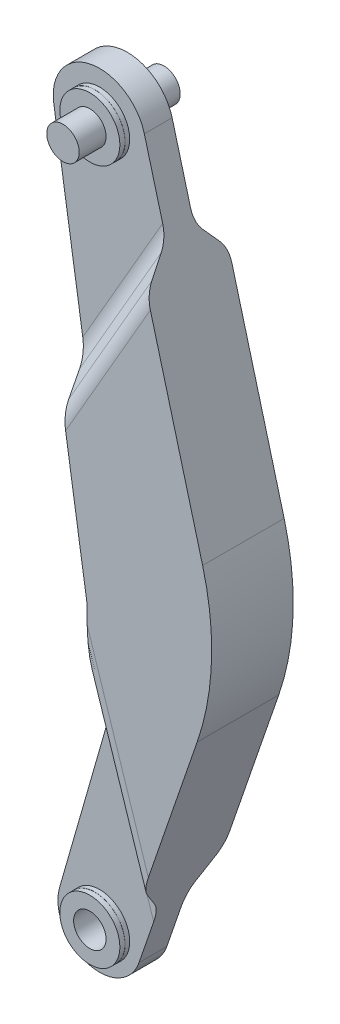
ISO-10303-21;
HEADER;
FILE_DESCRIPTION(('STEP AP214'),'2;1');
FILE_NAME('part.step','',(''),(''),'','','');
FILE_SCHEMA(('AUTOMOTIVE_DESIGN { 1 0 10303 214 1 1 1 1 }'));
ENDSEC;
DATA;
#1=APPLICATION_CONTEXT('core data for automotive mechanical design processes');
#2=APPLICATION_PROTOCOL_DEFINITION('international standard','automotive_design',2000,#1);
#3=PRODUCT_CONTEXT('',#1,'mechanical');
#4=PRODUCT('Part','Part','',(#3));
#5=PRODUCT_RELATED_PRODUCT_CATEGORY('part','',(#4));
#6=PRODUCT_DEFINITION_FORMATION('','',#4);
#7=PRODUCT_DEFINITION_CONTEXT('part definition',#1,'design');
#8=PRODUCT_DEFINITION('design','',#6,#7);
#9=PRODUCT_DEFINITION_SHAPE('','',#8);
#10=(LENGTH_UNIT() NAMED_UNIT(*) SI_UNIT(.MILLI.,.METRE.));
#11=(NAMED_UNIT(*) PLANE_ANGLE_UNIT() SI_UNIT($,.RADIAN.));
#12=(NAMED_UNIT(*) SI_UNIT($,.STERADIAN.) SOLID_ANGLE_UNIT());
#13=UNCERTAINTY_MEASURE_WITH_UNIT(LENGTH_MEASURE(1.E-05),#10,'distance_accuracy_value','');
#14=(GEOMETRIC_REPRESENTATION_CONTEXT(3) GLOBAL_UNCERTAINTY_ASSIGNED_CONTEXT((#13)) GLOBAL_UNIT_ASSIGNED_CONTEXT((#10,
#11,#12)) REPRESENTATION_CONTEXT('',''));
#15=CARTESIAN_POINT('',(0.,0.,0.));
#16=DIRECTION('',(0.,0.,1.));
#17=DIRECTION('',(1.,0.,0.));
#18=AXIS2_PLACEMENT_3D('',#15,#16,#17);
#19=CARTESIAN_POINT('',(0.,750.,35.));
#20=DIRECTION('',(0.,0.,1.));
#21=DIRECTION('',(1.,0.,0.));
#22=AXIS2_PLACEMENT_3D('',#19,#20,#21);
#23=PLANE('',#22);
#24=CARTESIAN_POINT('',(0.,750.,35.));
#25=DIRECTION('',(0.,0.,1.));
#26=DIRECTION('',(1.,0.,0.));
#27=AXIS2_PLACEMENT_3D('',#24,#25,#26);
#28=CIRCLE('',#27,32.5);
#29=CARTESIAN_POINT('',(32.5,750.,35.));
#30=VERTEX_POINT('',#29);
#31=EDGE_CURVE('E324',#30,#30,#28,.T.);
#32=ORIENTED_EDGE('',*,*,#31,.T.);
#33=EDGE_LOOP('',(#32));
#34=FACE_BOUND('',#33,.T.);
#35=CARTESIAN_POINT('',(0.,750.,35.));
#36=DIRECTION('',(0.,0.,1.));
#37=DIRECTION('',(1.,0.,0.));
#38=AXIS2_PLACEMENT_3D('',#35,#36,#37);
#39=CIRCLE('',#38,32.4);
#40=CARTESIAN_POINT('',(32.4,750.,35.));
#41=VERTEX_POINT('',#40);
#42=EDGE_CURVE('E1066',#41,#41,#39,.T.);
#43=ORIENTED_EDGE('',*,*,#42,.F.);
#44=EDGE_LOOP('',(#43));
#45=FACE_BOUND('',#44,.T.);
#46=ADVANCED_FACE('F16',(#34,#45),#23,.T.);
#47=CARTESIAN_POINT('',(0.,750.,-5.));
#48=DIRECTION('',(0.,0.,1.));
#49=DIRECTION('',(1.,0.,0.));
#50=AXIS2_PLACEMENT_3D('',#47,#48,#49);
#51=PLANE('',#50);
#52=CARTESIAN_POINT('',(0.,750.,-5.));
#53=DIRECTION('',(0.,0.,1.));
#54=DIRECTION('',(1.,0.,0.));
#55=AXIS2_PLACEMENT_3D('',#52,#53,#54);
#56=CIRCLE('',#55,32.5);
#57=CARTESIAN_POINT('',(32.5,750.,-5.));
#58=VERTEX_POINT('',#57);
#59=EDGE_CURVE('E321',#58,#58,#56,.T.);
#60=ORIENTED_EDGE('',*,*,#59,.F.);
#61=EDGE_LOOP('',(#60));
#62=FACE_BOUND('',#61,.T.);
#63=CARTESIAN_POINT('',(0.,750.,-5.));
#64=DIRECTION('',(0.,0.,1.));
#65=DIRECTION('',(1.,0.,0.));
#66=AXIS2_PLACEMENT_3D('',#63,#64,#65);
#67=CIRCLE('',#66,32.4);
#68=CARTESIAN_POINT('',(32.4,750.,-5.));
#69=VERTEX_POINT('',#68);
#70=EDGE_CURVE('E10',#69,#69,#67,.F.);
#71=ORIENTED_EDGE('',*,*,#70,.F.);
#72=EDGE_LOOP('',(#71));
#73=FACE_BOUND('',#72,.T.);
#74=ADVANCED_FACE('F516',(#62,#73),#51,.F.);
#75=CARTESIAN_POINT('',(0.,0.,35.));
#76=DIRECTION('',(0.,0.,1.));
#77=DIRECTION('',(1.,0.,0.));
#78=AXIS2_PLACEMENT_3D('',#75,#76,#77);
#79=PLANE('',#78);
#80=CARTESIAN_POINT('',(0.,0.,35.));
#81=DIRECTION('',(0.,0.,1.));
#82=DIRECTION('',(1.,0.,0.));
#83=AXIS2_PLACEMENT_3D('',#80,#81,#82);
#84=CIRCLE('',#83,32.5);
#85=CARTESIAN_POINT('',(32.5,0.,35.));
#86=VERTEX_POINT('',#85);
#87=EDGE_CURVE('E312',#86,#86,#84,.T.);
#88=ORIENTED_EDGE('',*,*,#87,.T.);
#89=EDGE_LOOP('',(#88));
#90=FACE_BOUND('',#89,.T.);
#91=CARTESIAN_POINT('',(0.,0.,35.));
#92=DIRECTION('',(0.,0.,1.));
#93=DIRECTION('',(1.,0.,0.));
#94=AXIS2_PLACEMENT_3D('',#91,#92,#93);
#95=CIRCLE('',#94,32.4);
#96=CARTESIAN_POINT('',(32.4,0.,35.));
#97=VERTEX_POINT('',#96);
#98=EDGE_CURVE('E1051',#97,#97,#95,.T.);
#99=ORIENTED_EDGE('',*,*,#98,.F.);
#100=EDGE_LOOP('',(#99));
#101=FACE_BOUND('',#100,.T.);
#102=ADVANCED_FACE('F504',(#90,#101),#79,.T.);
#103=CARTESIAN_POINT('',(0.,0.,-5.));
#104=DIRECTION('',(0.,0.,1.));
#105=DIRECTION('',(1.,0.,0.));
#106=AXIS2_PLACEMENT_3D('',#103,#104,#105);
#107=PLANE('',#106);
#108=CARTESIAN_POINT('',(0.,0.,-5.));
#109=DIRECTION('',(0.,0.,1.));
#110=DIRECTION('',(1.,0.,0.));
#111=AXIS2_PLACEMENT_3D('',#108,#109,#110);
#112=CIRCLE('',#111,32.5);
#113=CARTESIAN_POINT('',(32.5,0.,-5.));
#114=VERTEX_POINT('',#113);
#115=EDGE_CURVE('E309',#114,#114,#112,.T.);
#116=ORIENTED_EDGE('',*,*,#115,.F.);
#117=EDGE_LOOP('',(#116));
#118=FACE_BOUND('',#117,.T.);
#119=CARTESIAN_POINT('',(0.,0.,-5.));
#120=DIRECTION('',(0.,0.,1.));
#121=DIRECTION('',(1.,0.,0.));
#122=AXIS2_PLACEMENT_3D('',#119,#120,#121);
#123=CIRCLE('',#122,32.4);
#124=CARTESIAN_POINT('',(32.4,0.,-5.));
#125=VERTEX_POINT('',#124);
#126=EDGE_CURVE('E24',#125,#125,#123,.F.);
#127=ORIENTED_EDGE('',*,*,#126,.F.);
#128=EDGE_LOOP('',(#127));
#129=FACE_BOUND('',#128,.T.);
#130=ADVANCED_FACE('F501',(#118,#129),#107,.F.);
#131=CARTESIAN_POINT('',(29.9275917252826,252.511569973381,34.));
#132=DIRECTION('',(0.994521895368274,0.10452846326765,0.));
#133=DIRECTION('',(-0.10452846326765,0.994521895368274,0.));
#134=AXIS2_PLACEMENT_3D('',#131,#132,#133);
#135=PLANE('',#134);
#136=CARTESIAN_POINT('',(29.0683625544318,260.686589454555,-9.));
#137=DIRECTION('',(0.994521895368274,0.10452846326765,0.));
#138=DIRECTION('',(0.10452846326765,-0.994521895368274,0.));
#139=AXIS2_PLACEMENT_3D('',#136,#137,#138);
#140=ELLIPSE('',#139,96.1946868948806,20.);
#141=CARTESIAN_POINT('',(29.0683625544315,260.686589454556,-29.));
#142=VERTEX_POINT('',#141);
#143=CARTESIAN_POINT('',(29.9275917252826,252.511569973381,-28.9268453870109));
#144=VERTEX_POINT('',#143);
#145=EDGE_CURVE('E482',#142,#144,#140,.F.);
#146=ORIENTED_EDGE('',*,*,#145,.T.);
#147=DIRECTION('',(0.,0.,-1.));
#148=VECTOR('',#147,1.);
#149=CARTESIAN_POINT('',(29.9275917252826,252.511569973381,34.));
#150=LINE('',#149,#148);
#151=CARTESIAN_POINT('',(29.9275917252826,252.511569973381,34.));
#152=VERTEX_POINT('',#151);
#153=EDGE_CURVE('E276',#152,#144,#150,.T.);
#154=ORIENTED_EDGE('',*,*,#153,.F.);
#155=DIRECTION('',(0.10452846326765,-0.994521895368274,0.));
#156=VECTOR('',#155,1.);
#157=CARTESIAN_POINT('',(29.9275917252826,252.511569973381,34.));
#158=LINE('',#157,#156);
#159=CARTESIAN_POINT('',(17.3841761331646,371.854197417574,34.));
#160=VERTEX_POINT('',#159);
#161=EDGE_CURVE('E264',#160,#152,#158,.T.);
#162=ORIENTED_EDGE('',*,*,#161,.F.);
#163=DIRECTION('',(0.,0.,-1.));
#164=VECTOR('',#163,1.);
#165=CARTESIAN_POINT('',(17.3841761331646,371.854197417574,34.));
#166=LINE('',#165,#164);
#167=CARTESIAN_POINT('',(17.3841761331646,371.854197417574,-29.));
#168=VERTEX_POINT('',#167);
#169=EDGE_CURVE('E279',#160,#168,#166,.T.);
#170=ORIENTED_EDGE('',*,*,#169,.T.);
#171=DIRECTION('',(0.10452846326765,-0.994521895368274,0.));
#172=VECTOR('',#171,1.);
#173=CARTESIAN_POINT('',(29.9275917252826,252.511569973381,-29.));
#174=LINE('',#173,#172);
#175=EDGE_CURVE('E255',#168,#142,#174,.T.);
#176=ORIENTED_EDGE('',*,*,#175,.T.);
#177=EDGE_LOOP('',(#146,#154,#162,#170,#176));
#178=FACE_BOUND('',#177,.T.);
#179=DIRECTION('',(-0.10452846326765,0.994521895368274,0.));
#180=VECTOR('',#179,1.);
#181=CARTESIAN_POINT('',(18.9521030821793,356.93636898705,28.));
#182=LINE('',#181,#180);
#183=CARTESIAN_POINT('',(29.4049494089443,257.484179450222,28.));
#184=VERTEX_POINT('',#183);
#185=CARTESIAN_POINT('',(18.9521030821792,356.93636898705,28.));
#186=VERTEX_POINT('',#185);
#187=EDGE_CURVE('E251',#184,#186,#182,.T.);
#188=ORIENTED_EDGE('',*,*,#187,.F.);
#189=DIRECTION('',(0.,0.,1.));
#190=VECTOR('',#189,1.);
#191=CARTESIAN_POINT('',(29.4049494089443,257.484179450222,28.));
#192=LINE('',#191,#190);
#193=CARTESIAN_POINT('',(29.4049494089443,257.484179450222,-12.));
#194=VERTEX_POINT('',#193);
#195=EDGE_CURVE('E248',#194,#184,#192,.T.);
#196=ORIENTED_EDGE('',*,*,#195,.F.);
#197=DIRECTION('',(0.10452846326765,-0.994521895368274,0.));
#198=VECTOR('',#197,1.);
#199=CARTESIAN_POINT('',(18.9521030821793,356.93636898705,-12.));
#200=LINE('',#199,#198);
#201=CARTESIAN_POINT('',(18.9521030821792,356.93636898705,-12.));
#202=VERTEX_POINT('',#201);
#203=EDGE_CURVE('E36',#202,#194,#200,.T.);
#204=ORIENTED_EDGE('',*,*,#203,.F.);
#205=DIRECTION('',(0.,0.,-1.));
#206=VECTOR('',#205,1.);
#207=CARTESIAN_POINT('',(18.9521030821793,356.93636898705,28.));
#208=LINE('',#207,#206);
#209=EDGE_CURVE('E31',#186,#202,#208,.T.);
#210=ORIENTED_EDGE('',*,*,#209,.F.);
#211=EDGE_LOOP('',(#188,#196,#204,#210));
#212=FACE_BOUND('',#211,.T.);
#213=ADVANCED_FACE('F503',(#178,#212),#135,.F.);
#214=CARTESIAN_POINT('',(0.,750.,30.));
#215=DIRECTION('',(0.,0.,-1.));
#216=DIRECTION('',(-1.,0.,0.));
#217=AXIS2_PLACEMENT_3D('',#214,#215,#216);
#218=PLANE('',#217);
#219=CARTESIAN_POINT('',(0.,0.,30.));
#220=DIRECTION('',(0.,0.,-1.));
#221=DIRECTION('',(-1.,0.,0.));
#222=AXIS2_PLACEMENT_3D('',#219,#220,#221);
#223=CIRCLE('',#222,32.5);
#224=CARTESIAN_POINT('',(-32.5,0.,30.));
#225=VERTEX_POINT('',#224);
#226=EDGE_CURVE('E316',#225,#225,#223,.F.);
#227=ORIENTED_EDGE('',*,*,#226,.F.);
#228=EDGE_LOOP('',(#227));
#229=FACE_BOUND('',#228,.T.);
#230=DIRECTION('',(0.325568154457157,0.945518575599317,0.));
#231=VECTOR('',#230,1.);
#232=CARTESIAN_POINT('',(134.33572929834,251.919379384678,30.));
#233=LINE('',#232,#231);
#234=CARTESIAN_POINT('',(42.5483359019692,-14.6505669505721,30.));
#235=VERTEX_POINT('',#234);
#236=CARTESIAN_POINT('',(58.3867654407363,31.3475724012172,30.));
#237=VERTEX_POINT('',#236);
#238=EDGE_CURVE('E356',#235,#237,#233,.T.);
#239=ORIENTED_EDGE('',*,*,#238,.T.);
#240=DIRECTION('',(0.309016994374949,-0.951056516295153,0.));
#241=VECTOR('',#240,1.);
#242=CARTESIAN_POINT('',(-158.395323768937,698.534239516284,30.));
#243=LINE('',#242,#241);
#244=CARTESIAN_POINT('',(7.27872939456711,188.641933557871,30.));
#245=VERTEX_POINT('',#244);
#246=EDGE_CURVE('E458',#237,#245,#243,.F.);
#247=ORIENTED_EDGE('',*,*,#246,.T.);
#248=DIRECTION('',(-0.275637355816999,-0.961261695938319,0.));
#249=VECTOR('',#248,1.);
#250=CARTESIAN_POINT('',(17.,222.544033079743,30.));
#251=LINE('',#250,#249);
#252=CARTESIAN_POINT('',(-43.2567763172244,12.403681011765,30.));
#253=VERTEX_POINT('',#252);
#254=EDGE_CURVE('E352',#245,#253,#251,.T.);
#255=ORIENTED_EDGE('',*,*,#254,.T.);
#256=CARTESIAN_POINT('',(0.,0.,30.));
#257=DIRECTION('',(0.,0.,1.));
#258=DIRECTION('',(1.,0.,0.));
#259=AXIS2_PLACEMENT_3D('',#256,#257,#258);
#260=CIRCLE('',#259,45.);
#261=EDGE_CURVE('E354',#253,#235,#260,.T.);
#262=ORIENTED_EDGE('',*,*,#261,.T.);
#263=EDGE_LOOP('',(#239,#247,#255,#262));
#264=FACE_BOUND('',#263,.T.);
#265=ADVANCED_FACE('F513',(#229,#264),#218,.F.);
#266=CARTESIAN_POINT('',(0.,750.,0.));
#267=DIRECTION('',(0.,0.,-1.));
#268=DIRECTION('',(-1.,0.,0.));
#269=AXIS2_PLACEMENT_3D('',#266,#267,#268);
#270=PLANE('',#269);
#271=DIRECTION('',(-0.275637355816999,-0.961261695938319,0.));
#272=VECTOR('',#271,1.);
#273=CARTESIAN_POINT('',(17.,222.544033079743,0.));
#274=LINE('',#273,#272);
#275=CARTESIAN_POINT('',(7.27872939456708,188.641933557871,0.));
#276=VERTEX_POINT('',#275);
#277=CARTESIAN_POINT('',(-43.2567763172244,12.403681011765,0.));
#278=VERTEX_POINT('',#277);
#279=EDGE_CURVE('E337',#276,#278,#274,.T.);
#280=ORIENTED_EDGE('',*,*,#279,.F.);
#281=DIRECTION('',(-0.309016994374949,0.951056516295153,0.));
#282=VECTOR('',#281,1.);
#283=CARTESIAN_POINT('',(54.562302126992,43.1180601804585,0.));
#284=LINE('',#283,#282);
#285=CARTESIAN_POINT('',(58.3867654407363,31.3475724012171,0.));
#286=VERTEX_POINT('',#285);
#287=EDGE_CURVE('E416',#276,#286,#284,.F.);
#288=ORIENTED_EDGE('',*,*,#287,.T.);
#289=DIRECTION('',(0.325568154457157,0.945518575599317,0.));
#290=VECTOR('',#289,1.);
#291=CARTESIAN_POINT('',(134.33572929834,251.919379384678,0.));
#292=LINE('',#291,#290);
#293=CARTESIAN_POINT('',(42.5483359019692,-14.6505669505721,0.));
#294=VERTEX_POINT('',#293);
#295=EDGE_CURVE('E341',#294,#286,#292,.T.);
#296=ORIENTED_EDGE('',*,*,#295,.F.);
#297=CARTESIAN_POINT('',(0.,0.,0.));
#298=DIRECTION('',(0.,0.,1.));
#299=DIRECTION('',(1.,0.,0.));
#300=AXIS2_PLACEMENT_3D('',#297,#298,#299);
#301=CIRCLE('',#300,45.);
#302=EDGE_CURVE('E339',#278,#294,#301,.T.);
#303=ORIENTED_EDGE('',*,*,#302,.F.);
#304=EDGE_LOOP('',(#280,#288,#296,#303));
#305=FACE_BOUND('',#304,.T.);
#306=CARTESIAN_POINT('',(0.,0.,0.));
#307=DIRECTION('',(0.,0.,-1.));
#308=DIRECTION('',(-1.,0.,0.));
#309=AXIS2_PLACEMENT_3D('',#306,#307,#308);
#310=CIRCLE('',#309,32.5);
#311=CARTESIAN_POINT('',(-32.5,0.,0.));
#312=VERTEX_POINT('',#311);
#313=EDGE_CURVE('E315',#312,#312,#310,.F.);
#314=ORIENTED_EDGE('',*,*,#313,.T.);
#315=EDGE_LOOP('',(#314));
#316=FACE_BOUND('',#315,.T.);
#317=ADVANCED_FACE('F551',(#305,#316),#270,.T.);
#318=CARTESIAN_POINT('',(0.,750.,30.));
#319=DIRECTION('',(0.,0.,-1.));
#320=DIRECTION('',(-1.,0.,0.));
#321=AXIS2_PLACEMENT_3D('',#318,#319,#320);
#322=CIRCLE('',#321,32.5);
#323=CARTESIAN_POINT('',(-32.5,750.,30.));
#324=VERTEX_POINT('',#323);
#325=EDGE_CURVE('E320',#324,#324,#322,.F.);
#326=ORIENTED_EDGE('',*,*,#325,.F.);
#327=EDGE_LOOP('',(#326));
#328=FACE_BOUND('',#327,.T.);
#329=DIRECTION('',(0.15250756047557,-0.988302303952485,0.));
#330=VECTOR('',#329,1.);
#331=CARTESIAN_POINT('',(-49.4151151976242,742.374621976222,30.));
#332=LINE('',#331,#330);
#333=CARTESIAN_POINT('',(-49.4151151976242,742.374621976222,30.));
#334=VERTEX_POINT('',#333);
#335=CARTESIAN_POINT('',(-18.1426952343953,539.718408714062,30.));
#336=VERTEX_POINT('',#335);
#337=EDGE_CURVE('E349',#334,#336,#332,.T.);
#338=ORIENTED_EDGE('',*,*,#337,.T.);
#339=DIRECTION('',(-0.5,-0.866025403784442,0.));
#340=VECTOR('',#339,1.);
#341=CARTESIAN_POINT('',(77.4475785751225,705.285619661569,30.));
#342=LINE('',#341,#340);
#343=CARTESIAN_POINT('',(68.0885372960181,689.075284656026,30.));
#344=VERTEX_POINT('',#343);
#345=EDGE_CURVE('E445',#336,#344,#342,.F.);
#346=ORIENTED_EDGE('',*,*,#345,.T.);
#347=DIRECTION('',(-0.258819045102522,0.965925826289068,0.));
#348=VECTOR('',#347,1.);
#349=CARTESIAN_POINT('',(48.2962913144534,762.940952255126,30.));
#350=LINE('',#349,#348);
#351=CARTESIAN_POINT('',(48.2962913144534,762.940952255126,30.));
#352=VERTEX_POINT('',#351);
#353=EDGE_CURVE('E359',#344,#352,#350,.T.);
#354=ORIENTED_EDGE('',*,*,#353,.T.);
#355=CARTESIAN_POINT('',(0.,750.,30.));
#356=DIRECTION('',(0.,0.,1.));
#357=DIRECTION('',(-1.,0.,0.));
#358=AXIS2_PLACEMENT_3D('',#355,#356,#357);
#359=CIRCLE('',#358,50.);
#360=EDGE_CURVE('E346',#352,#334,#359,.T.);
#361=ORIENTED_EDGE('',*,*,#360,.T.);
#362=EDGE_LOOP('',(#338,#346,#354,#361));
#363=FACE_BOUND('',#362,.T.);
#364=ADVANCED_FACE('F549',(#328,#363),#218,.F.);
#365=DIRECTION('',(-0.258819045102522,0.965925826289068,0.));
#366=VECTOR('',#365,1.);
#367=CARTESIAN_POINT('',(48.2962913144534,762.940952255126,0.));
#368=LINE('',#367,#366);
#369=CARTESIAN_POINT('',(68.0885372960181,689.075284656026,0.));
#370=VERTEX_POINT('',#369);
#371=CARTESIAN_POINT('',(48.2962913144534,762.940952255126,0.));
#372=VERTEX_POINT('',#371);
#373=EDGE_CURVE('E344',#370,#372,#368,.T.);
#374=ORIENTED_EDGE('',*,*,#373,.F.);
#375=DIRECTION('',(0.5,0.866025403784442,0.));
#376=VECTOR('',#375,1.);
#377=CARTESIAN_POINT('',(-23.9481439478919,529.66307658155,0.));
#378=LINE('',#377,#376);
#379=CARTESIAN_POINT('',(-18.1426952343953,539.718408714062,0.));
#380=VERTEX_POINT('',#379);
#381=EDGE_CURVE('E443',#370,#380,#378,.F.);
#382=ORIENTED_EDGE('',*,*,#381,.T.);
#383=DIRECTION('',(0.15250756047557,-0.988302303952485,0.));
#384=VECTOR('',#383,1.);
#385=CARTESIAN_POINT('',(-49.4151151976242,742.374621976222,0.));
#386=LINE('',#385,#384);
#387=CARTESIAN_POINT('',(-49.4151151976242,742.374621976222,0.));
#388=VERTEX_POINT('',#387);
#389=EDGE_CURVE('E334',#388,#380,#386,.T.);
#390=ORIENTED_EDGE('',*,*,#389,.F.);
#391=CARTESIAN_POINT('',(0.,750.,0.));
#392=DIRECTION('',(0.,0.,1.));
#393=DIRECTION('',(-1.,0.,0.));
#394=AXIS2_PLACEMENT_3D('',#391,#392,#393);
#395=CIRCLE('',#394,50.);
#396=EDGE_CURVE('E331',#372,#388,#395,.T.);
#397=ORIENTED_EDGE('',*,*,#396,.F.);
#398=EDGE_LOOP('',(#374,#382,#390,#397));
#399=FACE_BOUND('',#398,.T.);
#400=CARTESIAN_POINT('',(0.,750.,0.));
#401=DIRECTION('',(0.,0.,-1.));
#402=DIRECTION('',(-1.,0.,0.));
#403=AXIS2_PLACEMENT_3D('',#400,#401,#402);
#404=CIRCLE('',#403,32.5);
#405=CARTESIAN_POINT('',(-32.5,750.,0.));
#406=VERTEX_POINT('',#405);
#407=EDGE_CURVE('E327',#406,#406,#404,.F.);
#408=ORIENTED_EDGE('',*,*,#407,.T.);
#409=EDGE_LOOP('',(#408));
#410=FACE_BOUND('',#409,.T.);
#411=ADVANCED_FACE('F545',(#399,#410),#270,.T.);
#412=CARTESIAN_POINT('',(0.,750.,30.));
#413=DIRECTION('',(0.,0.,-1.));
#414=DIRECTION('',(-1.,0.,0.));
#415=AXIS2_PLACEMENT_3D('',#412,#413,#414);
#416=CYLINDRICAL_SURFACE('',#415,50.);
#417=ORIENTED_EDGE('',*,*,#396,.T.);
#418=DIRECTION('',(0.,0.,-1.));
#419=VECTOR('',#418,1.);
#420=CARTESIAN_POINT('',(-49.4151151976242,742.374621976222,30.));
#421=LINE('',#420,#419);
#422=EDGE_CURVE('E330',#334,#388,#421,.T.);
#423=ORIENTED_EDGE('',*,*,#422,.F.);
#424=ORIENTED_EDGE('',*,*,#360,.F.);
#425=DIRECTION('',(0.,0.,-1.));
#426=VECTOR('',#425,1.);
#427=CARTESIAN_POINT('',(48.2962913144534,762.940952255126,30.));
#428=LINE('',#427,#426);
#429=EDGE_CURVE('E361',#352,#372,#428,.T.);
#430=ORIENTED_EDGE('',*,*,#429,.T.);
#431=EDGE_LOOP('',(#417,#423,#424,#430));
#432=FACE_BOUND('',#431,.T.);
#433=ADVANCED_FACE('F548',(#432),#416,.T.);
#434=CARTESIAN_POINT('',(-49.4151151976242,742.374621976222,30.));
#435=DIRECTION('',(0.988302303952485,0.15250756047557,0.));
#436=DIRECTION('',(-0.15250756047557,0.988302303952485,0.));
#437=AXIS2_PLACEMENT_3D('',#434,#435,#436);
#438=PLANE('',#437);
#439=DIRECTION('',(0.15250756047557,-0.988302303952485,0.));
#440=VECTOR('',#439,1.);
#441=CARTESIAN_POINT('',(15.2397538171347,323.388469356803,-29.));
#442=LINE('',#441,#440);
#443=CARTESIAN_POINT('',(-7.67408833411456,471.878176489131,-29.));
#444=VERTEX_POINT('',#443);
#445=CARTESIAN_POINT('',(7.05093915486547,376.454850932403,-29.));
#446=VERTEX_POINT('',#445);
#447=EDGE_CURVE('E304',#444,#446,#442,.T.);
#448=ORIENTED_EDGE('',*,*,#447,.T.);
#449=DIRECTION('',(0.,0.,-1.));
#450=VECTOR('',#449,1.);
#451=CARTESIAN_POINT('',(7.05093915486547,376.454850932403,34.));
#452=LINE('',#451,#450);
#453=CARTESIAN_POINT('',(7.05093915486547,376.454850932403,34.));
#454=VERTEX_POINT('',#453);
#455=EDGE_CURVE('E269',#454,#446,#452,.T.);
#456=ORIENTED_EDGE('',*,*,#455,.F.);
#457=DIRECTION('',(-0.15250756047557,0.988302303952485,0.));
#458=VECTOR('',#457,1.);
#459=CARTESIAN_POINT('',(-49.4151151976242,742.374621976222,34.));
#460=LINE('',#459,#458);
#461=CARTESIAN_POINT('',(15.2397538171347,323.388469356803,34.));
#462=VERTEX_POINT('',#461);
#463=EDGE_CURVE('E283',#462,#454,#460,.T.);
#464=ORIENTED_EDGE('',*,*,#463,.F.);
#465=DIRECTION('',(0.,0.,-1.));
#466=VECTOR('',#465,1.);
#467=CARTESIAN_POINT('',(15.2397538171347,323.388469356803,30.));
#468=LINE('',#467,#466);
#469=CARTESIAN_POINT('',(15.2397538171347,323.388469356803,59.));
#470=VERTEX_POINT('',#469);
#471=EDGE_CURVE('E375',#470,#462,#468,.T.);
#472=ORIENTED_EDGE('',*,*,#471,.F.);
#473=DIRECTION('',(0.15250756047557,-0.988302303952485,0.));
#474=VECTOR('',#473,1.);
#475=CARTESIAN_POINT('',(15.2397538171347,323.388469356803,59.));
#476=LINE('',#475,#474);
#477=CARTESIAN_POINT('',(-7.67408833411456,471.878176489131,59.));
#478=VERTEX_POINT('',#477);
#479=EDGE_CURVE('E291',#478,#470,#476,.T.);
#480=ORIENTED_EDGE('',*,*,#479,.F.);
#481=CARTESIAN_POINT('',(-7.67408833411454,471.878176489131,39.));
#482=DIRECTION('',(0.988302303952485,0.15250756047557,0.));
#483=DIRECTION('',(-0.15250756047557,0.988302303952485,0.));
#484=AXIS2_PLACEMENT_3D('',#481,#482,#483);
#485=ELLIPSE('',#484,31.9373224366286,20.);
#486=CARTESIAN_POINT('',(-11.4052480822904,496.057395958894,51.8557521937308));
#487=VERTEX_POINT('',#486);
#488=EDGE_CURVE('E439',#478,#487,#485,.F.);
#489=ORIENTED_EDGE('',*,*,#488,.T.);
#490=DIRECTION('',(0.12222231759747,-0.792043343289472,0.59810454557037));
#491=VECTOR('',#490,1.);
#492=CARTESIAN_POINT('',(4.25557089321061,394.569814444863,128.493204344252));
#493=LINE('',#492,#491);
#494=CARTESIAN_POINT('',(-14.4115354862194,515.539189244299,37.1442478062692));
#495=VERTEX_POINT('',#494);
#496=EDGE_CURVE('E405',#487,#495,#493,.F.);
#497=ORIENTED_EDGE('',*,*,#496,.T.);
#498=CARTESIAN_POINT('',(-18.1426952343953,539.718408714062,50.));
#499=DIRECTION('',(0.988302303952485,0.15250756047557,0.));
#500=DIRECTION('',(0.15250756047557,-0.988302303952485,0.));
#501=AXIS2_PLACEMENT_3D('',#498,#499,#500);
#502=ELLIPSE('',#501,31.9373224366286,20.);
#503=EDGE_CURVE('E476',#495,#336,#502,.T.);
#504=ORIENTED_EDGE('',*,*,#503,.T.);
#505=ORIENTED_EDGE('',*,*,#337,.F.);
#506=ORIENTED_EDGE('',*,*,#422,.T.);
#507=ORIENTED_EDGE('',*,*,#389,.T.);
#508=CARTESIAN_POINT('',(-18.1426952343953,539.718408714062,-20.));
#509=DIRECTION('',(0.988302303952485,0.15250756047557,0.));
#510=DIRECTION('',(0.15250756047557,-0.988302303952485,0.));
#511=AXIS2_PLACEMENT_3D('',#508,#509,#510);
#512=ELLIPSE('',#511,31.9373224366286,20.);
#513=CARTESIAN_POINT('',(-14.4115354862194,515.539189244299,-7.14424780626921));
#514=VERTEX_POINT('',#513);
#515=EDGE_CURVE('E472',#380,#514,#512,.T.);
#516=ORIENTED_EDGE('',*,*,#515,.T.);
#517=DIRECTION('',(0.12222231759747,-0.792043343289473,-0.598104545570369));
#518=VECTOR('',#517,1.);
#519=CARTESIAN_POINT('',(-29.2163374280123,611.479481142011,65.3042175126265));
#520=LINE('',#519,#518);
#521=CARTESIAN_POINT('',(-11.4052480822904,496.057395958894,-21.8557521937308));
#522=VERTEX_POINT('',#521);
#523=EDGE_CURVE('E391',#514,#522,#520,.T.);
#524=ORIENTED_EDGE('',*,*,#523,.T.);
#525=CARTESIAN_POINT('',(-7.67408833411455,471.878176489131,-9.));
#526=DIRECTION('',(0.988302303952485,0.15250756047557,0.));
#527=DIRECTION('',(0.15250756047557,-0.988302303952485,0.));
#528=AXIS2_PLACEMENT_3D('',#525,#526,#527);
#529=ELLIPSE('',#528,31.9373224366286,20.);
#530=EDGE_CURVE('E441',#522,#444,#529,.F.);
#531=ORIENTED_EDGE('',*,*,#530,.T.);
#532=EDGE_LOOP('',(#448,#456,#464,#472,#480,#489,#497,#504,#505,#506,#507,#516,#524,#531));
#533=FACE_BOUND('',#532,.T.);
#534=ADVANCED_FACE('F577',(#533),#438,.F.);
#535=CARTESIAN_POINT('',(15.2397538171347,323.388469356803,30.));
#536=DIRECTION('',(0.999847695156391,0.0174524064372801,0.));
#537=DIRECTION('',(-0.0174524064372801,0.999847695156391,0.));
#538=AXIS2_PLACEMENT_3D('',#535,#536,#537);
#539=PLANE('',#538);
#540=DIRECTION('',(0.0164806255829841,-0.944174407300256,0.329033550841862));
#541=VECTOR('',#540,1.);
#542=CARTESIAN_POINT('',(19.826921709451,60.5897968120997,44.0500724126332));
#543=LINE('',#542,#541);
#544=CARTESIAN_POINT('',(16.6453579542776,242.861462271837,-19.4694350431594));
#545=VERTEX_POINT('',#544);
#546=CARTESIAN_POINT('',(16.8956688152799,228.521162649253,-14.4720111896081));
#547=VERTEX_POINT('',#546);
#548=EDGE_CURVE('E386',#545,#547,#543,.T.);
#549=ORIENTED_EDGE('',*,*,#548,.T.);
#550=DIRECTION('',(0.,0.,-1.));
#551=VECTOR('',#550,1.);
#552=CARTESIAN_POINT('',(16.8956688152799,228.521162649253,42.3890526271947));
#553=LINE('',#552,#551);
#554=CARTESIAN_POINT('',(16.8956688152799,228.521162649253,44.472011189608));
#555=VERTEX_POINT('',#554);
#556=EDGE_CURVE('E491',#547,#555,#553,.F.);
#557=ORIENTED_EDGE('',*,*,#556,.T.);
#558=DIRECTION('',(0.0164806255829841,-0.944174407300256,-0.329033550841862));
#559=VECTOR('',#558,1.);
#560=CARTESIAN_POINT('',(14.3951325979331,371.776786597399,94.3948922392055));
#561=LINE('',#560,#559);
#562=CARTESIAN_POINT('',(16.525832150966,249.709090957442,51.8557521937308));
#563=VERTEX_POINT('',#562);
#564=EDGE_CURVE('E403',#555,#563,#561,.F.);
#565=ORIENTED_EDGE('',*,*,#564,.T.);
#566=CARTESIAN_POINT('',(15.6112895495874,302.10320150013,39.));
#567=DIRECTION('',(0.999847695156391,0.0174524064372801,0.));
#568=DIRECTION('',(-0.0174524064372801,0.999847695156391,0.));
#569=AXIS2_PLACEMENT_3D('',#566,#567,#568);
#570=ELLIPSE('',#569,68.4060723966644,20.);
#571=CARTESIAN_POINT('',(15.6112895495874,302.10320150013,59.));
#572=VERTEX_POINT('',#571);
#573=EDGE_CURVE('E424',#563,#572,#570,.F.);
#574=ORIENTED_EDGE('',*,*,#573,.T.);
#575=DIRECTION('',(0.0174524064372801,-0.999847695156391,0.));
#576=VECTOR('',#575,1.);
#577=CARTESIAN_POINT('',(17.,222.544033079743,59.));
#578=LINE('',#577,#576);
#579=EDGE_CURVE('E293',#470,#572,#578,.T.);
#580=ORIENTED_EDGE('',*,*,#579,.F.);
#581=ORIENTED_EDGE('',*,*,#471,.T.);
#582=DIRECTION('',(-0.0174524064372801,0.999847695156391,0.));
#583=VECTOR('',#582,1.);
#584=CARTESIAN_POINT('',(15.2397538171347,323.388469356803,34.));
#585=LINE('',#584,#583);
#586=CARTESIAN_POINT('',(16.6453579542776,242.861462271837,34.));
#587=VERTEX_POINT('',#586);
#588=EDGE_CURVE('E486',#587,#462,#585,.T.);
#589=ORIENTED_EDGE('',*,*,#588,.F.);
#590=DIRECTION('',(0.,0.,-1.));
#591=VECTOR('',#590,1.);
#592=CARTESIAN_POINT('',(16.6453579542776,242.861462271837,34.));
#593=LINE('',#592,#591);
#594=EDGE_CURVE('E272',#587,#545,#593,.T.);
#595=ORIENTED_EDGE('',*,*,#594,.T.);
#596=EDGE_LOOP('',(#549,#557,#565,#574,#580,#581,#589,#595));
#597=FACE_BOUND('',#596,.T.);
#598=ADVANCED_FACE('F573',(#597),#539,.F.);
#599=CARTESIAN_POINT('',(17.,222.544033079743,30.));
#600=DIRECTION('',(0.961261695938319,-0.275637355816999,0.));
#601=DIRECTION('',(0.275637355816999,0.961261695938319,0.));
#602=AXIS2_PLACEMENT_3D('',#599,#600,#601);
#603=PLANE('',#602);
#604=DIRECTION('',(-0.229370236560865,-0.799909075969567,-0.554558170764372));
#605=VECTOR('',#604,1.);
#606=CARTESIAN_POINT('',(46.6639481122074,325.994514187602,114.108840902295));
#607=LINE('',#606,#605);
#608=CARTESIAN_POINT('',(14.830701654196,214.978790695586,37.1442478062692));
#609=VERTEX_POINT('',#608);
#610=CARTESIAN_POINT('',(15.352228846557,216.797572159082,38.4051662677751));
#611=VERTEX_POINT('',#610);
#612=EDGE_CURVE('E400',#609,#611,#607,.F.);
#613=ORIENTED_EDGE('',*,*,#612,.T.);
#614=DIRECTION('',(0.,0.,-1.));
#615=VECTOR('',#614,1.);
#616=CARTESIAN_POINT('',(15.352228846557,216.797572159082,-12.3890526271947));
#617=LINE('',#616,#615);
#618=CARTESIAN_POINT('',(15.352228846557,216.797572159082,-8.40516626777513));
#619=VERTEX_POINT('',#618);
#620=EDGE_CURVE('E488',#611,#619,#617,.T.);
#621=ORIENTED_EDGE('',*,*,#620,.T.);
#622=DIRECTION('',(-0.229370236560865,-0.799909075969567,0.554558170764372));
#623=VECTOR('',#622,1.);
#624=CARTESIAN_POINT('',(-14.5245319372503,112.604925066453,63.8291482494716));
#625=LINE('',#624,#623);
#626=CARTESIAN_POINT('',(14.830701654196,214.978790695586,-7.14424780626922));
#627=VERTEX_POINT('',#626);
#628=EDGE_CURVE('E389',#619,#627,#625,.T.);
#629=ORIENTED_EDGE('',*,*,#628,.T.);
#630=CARTESIAN_POINT('',(7.27872939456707,188.641933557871,-20.));
#631=DIRECTION('',(0.961261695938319,-0.275637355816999,0.));
#632=DIRECTION('',(-0.275637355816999,-0.961261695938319,0.));
#633=AXIS2_PLACEMENT_3D('',#630,#631,#632);
#634=ELLIPSE('',#633,35.765832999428,20.);
#635=EDGE_CURVE('E466',#627,#276,#634,.T.);
#636=ORIENTED_EDGE('',*,*,#635,.T.);
#637=ORIENTED_EDGE('',*,*,#279,.T.);
#638=DIRECTION('',(0.,0.,-1.));
#639=VECTOR('',#638,1.);
#640=CARTESIAN_POINT('',(-43.2567763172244,12.403681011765,30.));
#641=LINE('',#640,#639);
#642=EDGE_CURVE('E372',#253,#278,#641,.T.);
#643=ORIENTED_EDGE('',*,*,#642,.F.);
#644=ORIENTED_EDGE('',*,*,#254,.F.);
#645=CARTESIAN_POINT('',(7.27872939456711,188.641933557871,50.));
#646=DIRECTION('',(0.961261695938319,-0.275637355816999,0.));
#647=DIRECTION('',(-0.275637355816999,-0.961261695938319,0.));
#648=AXIS2_PLACEMENT_3D('',#645,#646,#647);
#649=ELLIPSE('',#648,35.7658329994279,20.);
#650=EDGE_CURVE('E478',#245,#609,#649,.T.);
#651=ORIENTED_EDGE('',*,*,#650,.T.);
#652=EDGE_LOOP('',(#613,#621,#629,#636,#637,#643,#644,#651));
#653=FACE_BOUND('',#652,.T.);
#654=ADVANCED_FACE('F569',(#653),#603,.F.);
#655=CARTESIAN_POINT('',(0.,0.,30.));
#656=DIRECTION('',(0.,0.,-1.));
#657=DIRECTION('',(-1.,0.,0.));
#658=AXIS2_PLACEMENT_3D('',#655,#656,#657);
#659=CYLINDRICAL_SURFACE('',#658,45.);
#660=ORIENTED_EDGE('',*,*,#302,.T.);
#661=DIRECTION('',(0.,0.,-1.));
#662=VECTOR('',#661,1.);
#663=CARTESIAN_POINT('',(42.5483359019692,-14.6505669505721,30.));
#664=LINE('',#663,#662);
#665=EDGE_CURVE('E369',#235,#294,#664,.T.);
#666=ORIENTED_EDGE('',*,*,#665,.F.);
#667=ORIENTED_EDGE('',*,*,#261,.F.);
#668=ORIENTED_EDGE('',*,*,#642,.T.);
#669=EDGE_LOOP('',(#660,#666,#667,#668));
#670=FACE_BOUND('',#669,.T.);
#671=ADVANCED_FACE('F565',(#670),#659,.T.);
#672=CARTESIAN_POINT('',(134.33572929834,251.919379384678,30.));
#673=DIRECTION('',(-0.945518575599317,0.325568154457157,0.));
#674=DIRECTION('',(-0.325568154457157,-0.945518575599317,0.));
#675=AXIS2_PLACEMENT_3D('',#672,#673,#674);
#676=PLANE('',#675);
#677=DIRECTION('',(0.264558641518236,0.768334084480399,-0.582813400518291));
#678=VECTOR('',#677,1.);
#679=CARTESIAN_POINT('',(63.4320008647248,46.,1.21430643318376E-13));
#680=LINE('',#679,#678);
#681=CARTESIAN_POINT('',(66.6750156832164,55.418398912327,-7.14424780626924));
#682=VERTEX_POINT('',#681);
#683=CARTESIAN_POINT('',(73.3530632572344,74.8128573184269,-21.8557521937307));
#684=VERTEX_POINT('',#683);
#685=EDGE_CURVE('E319',#682,#684,#680,.T.);
#686=ORIENTED_EDGE('',*,*,#685,.T.);
#687=CARTESIAN_POINT('',(81.6413134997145,98.8836838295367,-9.));
#688=DIRECTION('',(-0.945518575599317,0.325568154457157,0.));
#689=DIRECTION('',(-0.325568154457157,-0.945518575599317,0.));
#690=AXIS2_PLACEMENT_3D('',#687,#688,#689);
#691=ELLIPSE('',#690,33.2328028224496,20.);
#692=CARTESIAN_POINT('',(81.6413134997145,98.8836838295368,-29.));
#693=VERTEX_POINT('',#692);
#694=EDGE_CURVE('E428',#684,#693,#691,.F.);
#695=ORIENTED_EDGE('',*,*,#694,.T.);
#696=DIRECTION('',(0.325568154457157,0.945518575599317,0.));
#697=VECTOR('',#696,1.);
#698=CARTESIAN_POINT('',(63.4320008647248,46.,-29.));
#699=LINE('',#698,#697);
#700=CARTESIAN_POINT('',(134.33572929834,251.919379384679,-29.));
#701=VERTEX_POINT('',#700);
#702=EDGE_CURVE('E307',#693,#701,#699,.T.);
#703=ORIENTED_EDGE('',*,*,#702,.T.);
#704=DIRECTION('',(0.,0.,-1.));
#705=VECTOR('',#704,1.);
#706=CARTESIAN_POINT('',(134.33572929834,251.919379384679,30.));
#707=LINE('',#706,#705);
#708=CARTESIAN_POINT('',(134.33572929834,251.919379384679,59.));
#709=VERTEX_POINT('',#708);
#710=EDGE_CURVE('E366',#709,#701,#707,.T.);
#711=ORIENTED_EDGE('',*,*,#710,.F.);
#712=DIRECTION('',(0.325568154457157,0.945518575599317,0.));
#713=VECTOR('',#712,1.);
#714=CARTESIAN_POINT('',(63.4320008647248,46.,59.));
#715=LINE('',#714,#713);
#716=CARTESIAN_POINT('',(81.6413134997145,98.8836838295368,59.));
#717=VERTEX_POINT('',#716);
#718=EDGE_CURVE('E296',#717,#709,#715,.T.);
#719=ORIENTED_EDGE('',*,*,#718,.F.);
#720=CARTESIAN_POINT('',(81.6413134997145,98.8836838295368,39.));
#721=DIRECTION('',(-0.945518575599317,0.325568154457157,0.));
#722=DIRECTION('',(0.325568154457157,0.945518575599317,0.));
#723=AXIS2_PLACEMENT_3D('',#720,#721,#722);
#724=ELLIPSE('',#723,33.2328028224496,20.);
#725=CARTESIAN_POINT('',(73.3530632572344,74.8128573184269,51.8557521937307));
#726=VERTEX_POINT('',#725);
#727=EDGE_CURVE('E426',#717,#726,#724,.F.);
#728=ORIENTED_EDGE('',*,*,#727,.T.);
#729=DIRECTION('',(0.264558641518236,0.768334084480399,0.582813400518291));
#730=VECTOR('',#729,1.);
#731=CARTESIAN_POINT('',(130.622412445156,241.135124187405,178.018118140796));
#732=LINE('',#731,#730);
#733=CARTESIAN_POINT('',(66.6750156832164,55.418398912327,37.1442478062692));
#734=VERTEX_POINT('',#733);
#735=EDGE_CURVE('E397',#726,#734,#732,.F.);
#736=ORIENTED_EDGE('',*,*,#735,.T.);
#737=CARTESIAN_POINT('',(58.3867654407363,31.3475724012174,50.));
#738=DIRECTION('',(-0.945518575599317,0.325568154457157,0.));
#739=DIRECTION('',(-0.325568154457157,-0.945518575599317,0.));
#740=AXIS2_PLACEMENT_3D('',#737,#738,#739);
#741=ELLIPSE('',#740,33.2328028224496,20.);
#742=EDGE_CURVE('E480',#734,#237,#741,.T.);
#743=ORIENTED_EDGE('',*,*,#742,.T.);
#744=ORIENTED_EDGE('',*,*,#238,.F.);
#745=ORIENTED_EDGE('',*,*,#665,.T.);
#746=ORIENTED_EDGE('',*,*,#295,.T.);
#747=CARTESIAN_POINT('',(58.3867654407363,31.3475724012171,-20.));
#748=DIRECTION('',(-0.945518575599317,0.325568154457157,0.));
#749=DIRECTION('',(-0.325568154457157,-0.945518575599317,0.));
#750=AXIS2_PLACEMENT_3D('',#747,#748,#749);
#751=ELLIPSE('',#750,33.2328028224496,20.);
#752=EDGE_CURVE('E468',#286,#682,#751,.T.);
#753=ORIENTED_EDGE('',*,*,#752,.T.);
#754=EDGE_LOOP('',(#686,#695,#703,#711,#719,#728,#736,#743,#744,#745,#746,#753));
#755=FACE_BOUND('',#754,.T.);
#756=ADVANCED_FACE('F561',(#755),#676,.F.);
#757=CARTESIAN_POINT('',(-137.51580697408,345.52537003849,30.));
#758=DIRECTION('',(0.,0.,-1.));
#759=DIRECTION('',(-1.,0.,0.));
#760=AXIS2_PLACEMENT_3D('',#757,#758,#759);
#761=CYLINDRICAL_SURFACE('',#760,287.51580697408);
#762=ORIENTED_EDGE('',*,*,#710,.T.);
#763=CARTESIAN_POINT('',(-137.51580697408,345.52537003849,-29.));
#764=DIRECTION('',(0.,0.,1.));
#765=DIRECTION('',(1.,0.,0.));
#766=AXIS2_PLACEMENT_3D('',#763,#764,#765);
#767=CIRCLE('',#766,287.51580697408);
#768=CARTESIAN_POINT('',(140.203136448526,419.939936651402,-29.));
#769=VERTEX_POINT('',#768);
#770=EDGE_CURVE('E298',#701,#769,#767,.T.);
#771=ORIENTED_EDGE('',*,*,#770,.T.);
#772=DIRECTION('',(0.,0.,-1.));
#773=VECTOR('',#772,1.);
#774=CARTESIAN_POINT('',(140.203136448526,419.939936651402,30.));
#775=LINE('',#774,#773);
#776=CARTESIAN_POINT('',(140.203136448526,419.939936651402,59.));
#777=VERTEX_POINT('',#776);
#778=EDGE_CURVE('E364',#777,#769,#775,.T.);
#779=ORIENTED_EDGE('',*,*,#778,.F.);
#780=CARTESIAN_POINT('',(-137.51580697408,345.52537003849,59.));
#781=DIRECTION('',(0.,0.,1.));
#782=DIRECTION('',(1.,0.,0.));
#783=AXIS2_PLACEMENT_3D('',#780,#781,#782);
#784=CIRCLE('',#783,287.51580697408);
#785=EDGE_CURVE('E285',#709,#777,#784,.T.);
#786=ORIENTED_EDGE('',*,*,#785,.F.);
#787=EDGE_LOOP('',(#762,#771,#779,#786));
#788=FACE_BOUND('',#787,.T.);
#789=ADVANCED_FACE('F557',(#788),#761,.T.);
#790=CARTESIAN_POINT('',(48.2962913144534,762.940952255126,30.));
#791=DIRECTION('',(-0.965925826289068,-0.258819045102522,0.));
#792=DIRECTION('',(0.258819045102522,-0.965925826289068,0.));
#793=AXIS2_PLACEMENT_3D('',#790,#791,#792);
#794=PLANE('',#793);
#795=DIRECTION('',(-0.258819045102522,0.965925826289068,0.));
#796=VECTOR('',#795,1.);
#797=CARTESIAN_POINT('',(140.203136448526,419.939936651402,-29.));
#798=LINE('',#797,#796);
#799=CARTESIAN_POINT('',(83.8225769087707,630.355049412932,-29.));
#800=VERTEX_POINT('',#799);
#801=EDGE_CURVE('E301',#769,#800,#798,.T.);
#802=ORIENTED_EDGE('',*,*,#801,.T.);
#803=CARTESIAN_POINT('',(83.8225769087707,630.355049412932,-9.));
#804=DIRECTION('',(-0.965925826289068,-0.258819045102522,0.));
#805=DIRECTION('',(0.258819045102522,-0.965925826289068,0.));
#806=AXIS2_PLACEMENT_3D('',#803,#804,#805);
#807=ELLIPSE('',#806,28.2842712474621,20.);
#808=CARTESIAN_POINT('',(78.2147423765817,651.283772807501,-21.8557521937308));
#809=VERTEX_POINT('',#808);
#810=EDGE_CURVE('E432',#800,#809,#807,.F.);
#811=ORIENTED_EDGE('',*,*,#810,.T.);
#812=DIRECTION('',(-0.197915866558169,0.738632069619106,0.64440047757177));
#813=VECTOR('',#812,1.);
#814=CARTESIAN_POINT('',(71.5021462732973,676.335522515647,0.));
#815=LINE('',#814,#813);
#816=CARTESIAN_POINT('',(73.6963718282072,668.146561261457,-7.14424780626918));
#817=VERTEX_POINT('',#816);
#818=EDGE_CURVE('E394',#809,#817,#815,.T.);
#819=ORIENTED_EDGE('',*,*,#818,.T.);
#820=CARTESIAN_POINT('',(68.0885372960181,689.075284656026,-20.));
#821=DIRECTION('',(-0.965925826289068,-0.258819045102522,0.));
#822=DIRECTION('',(0.258819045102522,-0.965925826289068,0.));
#823=AXIS2_PLACEMENT_3D('',#820,#821,#822);
#824=ELLIPSE('',#823,28.2842712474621,20.);
#825=EDGE_CURVE('E470',#817,#370,#824,.T.);
#826=ORIENTED_EDGE('',*,*,#825,.T.);
#827=ORIENTED_EDGE('',*,*,#373,.T.);
#828=ORIENTED_EDGE('',*,*,#429,.F.);
#829=ORIENTED_EDGE('',*,*,#353,.F.);
#830=CARTESIAN_POINT('',(68.0885372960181,689.075284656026,50.));
#831=DIRECTION('',(-0.965925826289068,-0.258819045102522,0.));
#832=DIRECTION('',(0.258819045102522,-0.965925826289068,0.));
#833=AXIS2_PLACEMENT_3D('',#830,#831,#832);
#834=ELLIPSE('',#833,28.2842712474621,20.);
#835=CARTESIAN_POINT('',(73.6963718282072,668.146561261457,37.1442478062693));
#836=VERTEX_POINT('',#835);
#837=EDGE_CURVE('E474',#344,#836,#834,.T.);
#838=ORIENTED_EDGE('',*,*,#837,.T.);
#839=DIRECTION('',(-0.197915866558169,0.738632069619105,-0.644400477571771));
#840=VECTOR('',#839,1.);
#841=CARTESIAN_POINT('',(119.648114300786,496.652323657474,186.759967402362));
#842=LINE('',#841,#840);
#843=CARTESIAN_POINT('',(78.2147423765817,651.283772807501,51.8557521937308));
#844=VERTEX_POINT('',#843);
#845=EDGE_CURVE('E408',#836,#844,#842,.F.);
#846=ORIENTED_EDGE('',*,*,#845,.T.);
#847=CARTESIAN_POINT('',(83.8225769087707,630.355049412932,39.));
#848=DIRECTION('',(-0.965925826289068,-0.258819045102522,0.));
#849=DIRECTION('',(-0.258819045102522,0.965925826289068,0.));
#850=AXIS2_PLACEMENT_3D('',#847,#848,#849);
#851=ELLIPSE('',#850,28.2842712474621,20.);
#852=CARTESIAN_POINT('',(83.8225769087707,630.355049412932,59.));
#853=VERTEX_POINT('',#852);
#854=EDGE_CURVE('E430',#844,#853,#851,.F.);
#855=ORIENTED_EDGE('',*,*,#854,.T.);
#856=DIRECTION('',(-0.258819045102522,0.965925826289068,0.));
#857=VECTOR('',#856,1.);
#858=CARTESIAN_POINT('',(140.203136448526,419.939936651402,59.));
#859=LINE('',#858,#857);
#860=EDGE_CURVE('E288',#777,#853,#859,.T.);
#861=ORIENTED_EDGE('',*,*,#860,.F.);
#862=ORIENTED_EDGE('',*,*,#778,.T.);
#863=EDGE_LOOP('',(#802,#811,#819,#826,#827,#828,#829,#838,#846,#855,#861,#862));
#864=FACE_BOUND('',#863,.T.);
#865=ADVANCED_FACE('F537',(#864),#794,.F.);
#866=CARTESIAN_POINT('',(0.,750.,35.));
#867=DIRECTION('',(0.,0.,-1.));
#868=DIRECTION('',(-1.,0.,0.));
#869=AXIS2_PLACEMENT_3D('',#866,#867,#868);
#870=CYLINDRICAL_SURFACE('',#869,32.5);
#871=ORIENTED_EDGE('',*,*,#407,.F.);
#872=EDGE_LOOP('',(#871));
#873=FACE_BOUND('',#872,.T.);
#874=ORIENTED_EDGE('',*,*,#59,.T.);
#875=EDGE_LOOP('',(#874));
#876=FACE_BOUND('',#875,.T.);
#877=ADVANCED_FACE('F533',(#873,#876),#870,.T.);
#878=ORIENTED_EDGE('',*,*,#31,.F.);
#879=EDGE_LOOP('',(#878));
#880=FACE_BOUND('',#879,.T.);
#881=ORIENTED_EDGE('',*,*,#325,.T.);
#882=EDGE_LOOP('',(#881));
#883=FACE_BOUND('',#882,.T.);
#884=ADVANCED_FACE('F536',(#880,#883),#870,.T.);
#885=CARTESIAN_POINT('',(0.,0.,35.));
#886=DIRECTION('',(0.,0.,-1.));
#887=DIRECTION('',(-1.,0.,0.));
#888=AXIS2_PLACEMENT_3D('',#885,#886,#887);
#889=CYLINDRICAL_SURFACE('',#888,32.5);
#890=ORIENTED_EDGE('',*,*,#313,.F.);
#891=EDGE_LOOP('',(#890));
#892=FACE_BOUND('',#891,.T.);
#893=ORIENTED_EDGE('',*,*,#115,.T.);
#894=EDGE_LOOP('',(#893));
#895=FACE_BOUND('',#894,.T.);
#896=ADVANCED_FACE('F543',(#892,#895),#889,.T.);
#897=CARTESIAN_POINT('',(0.,0.,30.));
#898=DIRECTION('',(0.,0.,-1.));
#899=DIRECTION('',(-1.,0.,0.));
#900=AXIS2_PLACEMENT_3D('',#897,#898,#899);
#901=CYLINDRICAL_SURFACE('',#900,17.5);
#902=CARTESIAN_POINT('',(0.,0.,-10.5));
#903=DIRECTION('',(0.,0.,-1.));
#904=DIRECTION('',(-1.,0.,0.));
#905=AXIS2_PLACEMENT_3D('',#902,#903,#904);
#906=CIRCLE('',#905,17.5);
#907=CARTESIAN_POINT('',(-17.5,0.,-10.5));
#908=VERTEX_POINT('',#907);
#909=EDGE_CURVE('E1047',#908,#908,#906,.T.);
#910=ORIENTED_EDGE('',*,*,#909,.T.);
#911=EDGE_LOOP('',(#910));
#912=FACE_BOUND('',#911,.T.);
#913=CARTESIAN_POINT('',(0.,0.,40.5));
#914=DIRECTION('',(0.,0.,1.));
#915=DIRECTION('',(1.,0.,0.));
#916=AXIS2_PLACEMENT_3D('',#913,#914,#915);
#917=CIRCLE('',#916,17.5);
#918=CARTESIAN_POINT('',(17.5,0.,40.5));
#919=VERTEX_POINT('',#918);
#920=EDGE_CURVE('E1054',#919,#919,#917,.T.);
#921=ORIENTED_EDGE('',*,*,#920,.T.);
#922=EDGE_LOOP('',(#921));
#923=FACE_BOUND('',#922,.T.);
#924=ADVANCED_FACE('F539',(#912,#923),#901,.F.);
#925=ORIENTED_EDGE('',*,*,#87,.F.);
#926=EDGE_LOOP('',(#925));
#927=FACE_BOUND('',#926,.T.);
#928=ORIENTED_EDGE('',*,*,#226,.T.);
#929=EDGE_LOOP('',(#928));
#930=FACE_BOUND('',#929,.T.);
#931=ADVANCED_FACE('F542',(#927,#930),#889,.T.);
#932=CARTESIAN_POINT('',(-137.51580697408,345.52537003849,-29.));
#933=DIRECTION('',(0.,0.,1.));
#934=DIRECTION('',(1.,0.,0.));
#935=AXIS2_PLACEMENT_3D('',#932,#933,#934);
#936=PLANE('',#935);
#937=DIRECTION('',(-0.309016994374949,0.951056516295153,0.));
#938=VECTOR('',#937,1.);
#939=CARTESIAN_POINT('',(25.0376899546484,273.091724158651,-29.));
#940=LINE('',#939,#938);
#941=EDGE_CURVE('E421',#693,#142,#940,.T.);
#942=ORIENTED_EDGE('',*,*,#941,.T.);
#943=ORIENTED_EDGE('',*,*,#175,.F.);
#944=DIRECTION('',(0.913545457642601,-0.4067366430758,0.));
#945=VECTOR('',#944,1.);
#946=CARTESIAN_POINT('',(17.3841761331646,371.854197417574,-29.));
#947=LINE('',#946,#945);
#948=EDGE_CURVE('E252',#446,#168,#947,.T.);
#949=ORIENTED_EDGE('',*,*,#948,.F.);
#950=ORIENTED_EDGE('',*,*,#447,.F.);
#951=DIRECTION('',(0.5,0.866025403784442,0.));
#952=VECTOR('',#951,1.);
#953=CARTESIAN_POINT('',(88.4856534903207,638.431734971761,-29.));
#954=LINE('',#953,#952);
#955=EDGE_CURVE('E418',#444,#800,#954,.T.);
#956=ORIENTED_EDGE('',*,*,#955,.T.);
#957=ORIENTED_EDGE('',*,*,#801,.F.);
#958=ORIENTED_EDGE('',*,*,#770,.F.);
#959=ORIENTED_EDGE('',*,*,#702,.F.);
#960=EDGE_LOOP('',(#942,#943,#949,#950,#956,#957,#958,#959));
#961=FACE_BOUND('',#960,.T.);
#962=ADVANCED_FACE('F613',(#961),#936,.F.);
#963=CARTESIAN_POINT('',(-137.51580697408,345.52537003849,59.));
#964=DIRECTION('',(0.,0.,1.));
#965=DIRECTION('',(1.,0.,0.));
#966=AXIS2_PLACEMENT_3D('',#963,#964,#965);
#967=PLANE('',#966);
#968=ORIENTED_EDGE('',*,*,#860,.T.);
#969=DIRECTION('',(0.5,0.866025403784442,0.));
#970=VECTOR('',#969,1.);
#971=CARTESIAN_POINT('',(-94.8468881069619,320.890458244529,59.));
#972=LINE('',#971,#970);
#973=EDGE_CURVE('E455',#853,#478,#972,.F.);
#974=ORIENTED_EDGE('',*,*,#973,.T.);
#975=ORIENTED_EDGE('',*,*,#479,.T.);
#976=ORIENTED_EDGE('',*,*,#579,.T.);
#977=DIRECTION('',(-0.309016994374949,0.951056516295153,0.));
#978=VECTOR('',#977,1.);
#979=CARTESIAN_POINT('',(-11.7725021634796,386.381846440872,59.));
#980=LINE('',#979,#978);
#981=EDGE_CURVE('E452',#572,#717,#980,.F.);
#982=ORIENTED_EDGE('',*,*,#981,.T.);
#983=ORIENTED_EDGE('',*,*,#718,.T.);
#984=ORIENTED_EDGE('',*,*,#785,.T.);
#985=EDGE_LOOP('',(#968,#974,#975,#976,#982,#983,#984));
#986=FACE_BOUND('',#985,.T.);
#987=ADVANCED_FACE('F694',(#986),#967,.T.);
#988=CARTESIAN_POINT('',(63.4320008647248,46.,1.21430643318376E-13));
#989=DIRECTION('',(-0.728551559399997,-0.236720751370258,-0.642787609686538));
#990=DIRECTION('',(-0.661591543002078,0.,0.749864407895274));
#991=AXIS2_PLACEMENT_3D('',#988,#989,#990);
#992=PLANE('',#991);
#993=DIRECTION('',(-0.535238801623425,-0.388873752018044,0.749864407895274));
#994=VECTOR('',#993,1.);
#995=CARTESIAN_POINT('',(-18.7401704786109,217.152370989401,30.1053496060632));
#996=LINE('',#995,#994);
#997=CARTESIAN_POINT('',(18.3486652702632,244.098987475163,-21.8557521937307));
#998=VERTEX_POINT('',#997);
#999=EDGE_CURVE('E275',#998,#545,#996,.T.);
#1000=ORIENTED_EDGE('',*,*,#999,.F.);
#1001=DIRECTION('',(-0.309016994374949,0.951056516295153,0.));
#1002=VECTOR('',#1001,1.);
#1003=CARTESIAN_POINT('',(70.8947456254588,82.3787810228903,-21.8557521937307));
#1004=LINE('',#1003,#1002);
#1005=EDGE_CURVE('E411',#998,#684,#1004,.F.);
#1006=ORIENTED_EDGE('',*,*,#1005,.T.);
#1007=ORIENTED_EDGE('',*,*,#685,.F.);
#1008=DIRECTION('',(-0.309016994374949,0.951056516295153,0.));
#1009=VECTOR('',#1008,1.);
#1010=CARTESIAN_POINT('',(17.5771090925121,206.526217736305,-7.14424780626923));
#1011=LINE('',#1010,#1009);
#1012=EDGE_CURVE('E413',#682,#627,#1011,.T.);
#1013=ORIENTED_EDGE('',*,*,#1012,.T.);
#1014=ORIENTED_EDGE('',*,*,#628,.F.);
#1015=CARTESIAN_POINT('',(-23.0982389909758,227.823066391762,31.1151739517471));
#1016=DIRECTION('',(-0.728551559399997,-0.236720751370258,-0.642787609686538));
#1017=DIRECTION('',(-0.611327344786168,-0.198632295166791,0.766044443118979));
#1018=AXIS2_PLACEMENT_3D('',#1015,#1016,#1017);
#1019=ELLIPSE('',#1018,62.2289530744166,40.);
#1020=EDGE_CURVE('E493',#619,#547,#1019,.F.);
#1021=ORIENTED_EDGE('',*,*,#1020,.T.);
#1022=ORIENTED_EDGE('',*,*,#548,.F.);
#1023=EDGE_LOOP('',(#1000,#1006,#1007,#1013,#1014,#1021,#1022));
#1024=FACE_BOUND('',#1023,.T.);
#1025=ADVANCED_FACE('F691',(#1024),#992,.T.);
#1026=CARTESIAN_POINT('',(71.5021462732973,676.335522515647,0.));
#1027=DIRECTION('',(-0.663413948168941,0.383022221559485,-0.642787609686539));
#1028=DIRECTION('',(-0.695854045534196,0.,0.718183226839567));
#1029=AXIS2_PLACEMENT_3D('',#1026,#1027,#1028);
#1030=PLANE('',#1029);
#1031=ORIENTED_EDGE('',*,*,#818,.F.);
#1032=DIRECTION('',(0.5,0.866025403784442,0.));
#1033=VECTOR('',#1032,1.);
#1034=CARTESIAN_POINT('',(-15.1369185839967,489.593953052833,-21.8557521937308));
#1035=LINE('',#1034,#1033);
#1036=EDGE_CURVE('E437',#809,#522,#1035,.F.);
#1037=ORIENTED_EDGE('',*,*,#1036,.T.);
#1038=ORIENTED_EDGE('',*,*,#523,.F.);
#1039=DIRECTION('',(0.5,0.866025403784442,0.));
#1040=VECTOR('',#1039,1.);
#1041=CARTESIAN_POINT('',(76.693739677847,673.338154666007,-7.1442478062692));
#1042=LINE('',#1041,#1040);
#1043=EDGE_CURVE('E434',#514,#817,#1042,.T.);
#1044=ORIENTED_EDGE('',*,*,#1043,.T.);
#1045=EDGE_LOOP('',(#1031,#1037,#1038,#1044));
#1046=FACE_BOUND('',#1045,.T.);
#1047=ADVANCED_FACE('F604',(#1046),#1030,.T.);
#1048=CARTESIAN_POINT('',(-20.6422009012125,383.49990662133,59.));
#1049=DIRECTION('',(0.728551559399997,0.236720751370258,-0.642787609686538));
#1050=DIRECTION('',(-0.661591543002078,0.,-0.749864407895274));
#1051=AXIS2_PLACEMENT_3D('',#1048,#1049,#1050);
#1052=PLANE('',#1051);
#1053=ORIENTED_EDGE('',*,*,#612,.F.);
#1054=DIRECTION('',(-0.309016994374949,0.951056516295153,0.));
#1055=VECTOR('',#1054,1.);
#1056=CARTESIAN_POINT('',(-38.0837724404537,377.832796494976,37.1442478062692));
#1057=LINE('',#1056,#1055);
#1058=EDGE_CURVE('E464',#609,#734,#1057,.F.);
#1059=ORIENTED_EDGE('',*,*,#1058,.T.);
#1060=ORIENTED_EDGE('',*,*,#735,.F.);
#1061=DIRECTION('',(0.309016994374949,-0.951056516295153,0.));
#1062=VECTOR('',#1061,1.);
#1063=CARTESIAN_POINT('',(-26.3435333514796,381.647431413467,51.8557521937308));
#1064=LINE('',#1063,#1062);
#1065=EDGE_CURVE('E461',#726,#563,#1064,.F.);
#1066=ORIENTED_EDGE('',*,*,#1065,.T.);
#1067=ORIENTED_EDGE('',*,*,#564,.F.);
#1068=CARTESIAN_POINT('',(-23.0982389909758,227.823066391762,-1.1151739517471));
#1069=DIRECTION('',(0.728551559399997,0.236720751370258,-0.642787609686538));
#1070=DIRECTION('',(0.611327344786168,0.198632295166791,0.766044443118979));
#1071=AXIS2_PLACEMENT_3D('',#1068,#1069,#1070);
#1072=ELLIPSE('',#1071,62.2289530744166,40.);
#1073=EDGE_CURVE('E495',#555,#611,#1072,.T.);
#1074=ORIENTED_EDGE('',*,*,#1073,.T.);
#1075=EDGE_LOOP('',(#1053,#1059,#1060,#1066,#1067,#1074));
#1076=FACE_BOUND('',#1075,.T.);
#1077=ADVANCED_FACE('F684',(#1076),#1052,.F.);
#1078=CARTESIAN_POINT('',(-102.923573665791,325.553534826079,59.));
#1079=DIRECTION('',(0.663413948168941,-0.383022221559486,-0.642787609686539));
#1080=DIRECTION('',(-0.695854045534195,0.,-0.718183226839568));
#1081=AXIS2_PLACEMENT_3D('',#1078,#1079,#1080);
#1082=PLANE('',#1081);
#1083=ORIENTED_EDGE('',*,*,#845,.F.);
#1084=DIRECTION('',(0.5,0.866025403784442,0.));
#1085=VECTOR('',#1084,1.);
#1086=CARTESIAN_POINT('',(-118.805746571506,334.72311162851,37.1442478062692));
#1087=LINE('',#1086,#1085);
#1088=EDGE_CURVE('E450',#836,#495,#1087,.F.);
#1089=ORIENTED_EDGE('',*,*,#1088,.T.);
#1090=ORIENTED_EDGE('',*,*,#496,.F.);
#1091=DIRECTION('',(-0.5,-0.866025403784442,0.));
#1092=VECTOR('',#1091,1.);
#1093=CARTESIAN_POINT('',(-108.115167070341,328.550902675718,51.8557521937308));
#1094=LINE('',#1093,#1092);
#1095=EDGE_CURVE('E448',#487,#844,#1094,.F.);
#1096=ORIENTED_EDGE('',*,*,#1095,.T.);
#1097=EDGE_LOOP('',(#1083,#1089,#1090,#1096));
#1098=FACE_BOUND('',#1097,.T.);
#1099=ADVANCED_FACE('F680',(#1098),#1082,.F.);
#1100=CARTESIAN_POINT('',(54.562302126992,43.1180601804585,-20.));
#1101=DIRECTION('',(0.309016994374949,-0.951056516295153,0.));
#1102=DIRECTION('',(0.951056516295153,0.309016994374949,0.));
#1103=AXIS2_PLACEMENT_3D('',#1100,#1101,#1102);
#1104=CYLINDRICAL_SURFACE('',#1103,20.);
#1105=ORIENTED_EDGE('',*,*,#752,.F.);
#1106=ORIENTED_EDGE('',*,*,#287,.F.);
#1107=ORIENTED_EDGE('',*,*,#635,.F.);
#1108=ORIENTED_EDGE('',*,*,#1012,.F.);
#1109=EDGE_LOOP('',(#1105,#1106,#1107,#1108));
#1110=FACE_BOUND('',#1109,.T.);
#1111=ADVANCED_FACE('F677',(#1110),#1104,.F.);
#1112=CARTESIAN_POINT('',(-11.7725021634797,386.381846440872,-9.));
#1113=DIRECTION('',(0.309016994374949,-0.951056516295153,0.));
#1114=DIRECTION('',(0.951056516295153,0.309016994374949,0.));
#1115=AXIS2_PLACEMENT_3D('',#1112,#1113,#1114);
#1116=CYLINDRICAL_SURFACE('',#1115,20.);
#1117=CARTESIAN_POINT('',(31.3813917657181,253.567817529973,-9.));
#1118=DIRECTION('',(0.587785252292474,-0.809016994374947,0.));
#1119=DIRECTION('',(-0.809016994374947,-0.587785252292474,0.));
#1120=AXIS2_PLACEMENT_3D('',#1117,#1118,#1119);
#1121=ELLIPSE('',#1120,21.0292444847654,20.);
#1122=EDGE_CURVE('E484',#144,#998,#1121,.F.);
#1123=ORIENTED_EDGE('',*,*,#1122,.F.);
#1124=ORIENTED_EDGE('',*,*,#145,.F.);
#1125=ORIENTED_EDGE('',*,*,#941,.F.);
#1126=ORIENTED_EDGE('',*,*,#694,.F.);
#1127=ORIENTED_EDGE('',*,*,#1005,.F.);
#1128=EDGE_LOOP('',(#1123,#1124,#1125,#1126,#1127));
#1129=FACE_BOUND('',#1128,.T.);
#1130=ADVANCED_FACE('F626',(#1129),#1116,.T.);
#1131=CARTESIAN_POINT('',(-94.8468881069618,320.890458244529,-9.));
#1132=DIRECTION('',(-0.5,-0.866025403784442,0.));
#1133=DIRECTION('',(0.866025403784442,-0.5,0.));
#1134=AXIS2_PLACEMENT_3D('',#1131,#1132,#1133);
#1135=CYLINDRICAL_SURFACE('',#1134,20.);
#1136=ORIENTED_EDGE('',*,*,#530,.F.);
#1137=ORIENTED_EDGE('',*,*,#1036,.F.);
#1138=ORIENTED_EDGE('',*,*,#810,.F.);
#1139=ORIENTED_EDGE('',*,*,#955,.F.);
#1140=EDGE_LOOP('',(#1136,#1137,#1138,#1139));
#1141=FACE_BOUND('',#1140,.T.);
#1142=ADVANCED_FACE('F610',(#1141),#1135,.T.);
#1143=CARTESIAN_POINT('',(63.4254607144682,680.998599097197,-20.));
#1144=DIRECTION('',(-0.5,-0.866025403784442,0.));
#1145=DIRECTION('',(0.866025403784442,-0.5,0.));
#1146=AXIS2_PLACEMENT_3D('',#1143,#1144,#1145);
#1147=CYLINDRICAL_SURFACE('',#1146,20.);
#1148=ORIENTED_EDGE('',*,*,#515,.F.);
#1149=ORIENTED_EDGE('',*,*,#381,.F.);
#1150=ORIENTED_EDGE('',*,*,#825,.F.);
#1151=ORIENTED_EDGE('',*,*,#1043,.F.);
#1152=EDGE_LOOP('',(#1148,#1149,#1150,#1151));
#1153=FACE_BOUND('',#1152,.T.);
#1154=ADVANCED_FACE('F601',(#1153),#1147,.F.);
#1155=CARTESIAN_POINT('',(77.4475785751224,705.285619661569,50.));
#1156=DIRECTION('',(-0.5,-0.866025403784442,0.));
#1157=DIRECTION('',(0.866025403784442,-0.5,0.));
#1158=AXIS2_PLACEMENT_3D('',#1155,#1156,#1157);
#1159=CYLINDRICAL_SURFACE('',#1158,20.);
#1160=ORIENTED_EDGE('',*,*,#503,.F.);
#1161=ORIENTED_EDGE('',*,*,#1088,.F.);
#1162=ORIENTED_EDGE('',*,*,#837,.F.);
#1163=ORIENTED_EDGE('',*,*,#345,.F.);
#1164=EDGE_LOOP('',(#1160,#1161,#1162,#1163));
#1165=FACE_BOUND('',#1164,.T.);
#1166=ADVANCED_FACE('F666',(#1165),#1159,.F.);
#1167=CARTESIAN_POINT('',(-94.8468881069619,320.890458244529,39.));
#1168=DIRECTION('',(0.5,0.866025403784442,0.));
#1169=DIRECTION('',(-0.866025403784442,0.5,0.));
#1170=AXIS2_PLACEMENT_3D('',#1167,#1168,#1169);
#1171=CYLINDRICAL_SURFACE('',#1170,20.);
#1172=ORIENTED_EDGE('',*,*,#854,.F.);
#1173=ORIENTED_EDGE('',*,*,#1095,.F.);
#1174=ORIENTED_EDGE('',*,*,#488,.F.);
#1175=ORIENTED_EDGE('',*,*,#973,.F.);
#1176=EDGE_LOOP('',(#1172,#1173,#1174,#1175));
#1177=FACE_BOUND('',#1176,.T.);
#1178=ADVANCED_FACE('F662',(#1177),#1171,.T.);
#1179=CARTESIAN_POINT('',(-158.395323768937,698.534239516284,50.));
#1180=DIRECTION('',(0.309016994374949,-0.951056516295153,0.));
#1181=DIRECTION('',(0.951056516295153,0.309016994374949,0.));
#1182=AXIS2_PLACEMENT_3D('',#1179,#1180,#1181);
#1183=CYLINDRICAL_SURFACE('',#1182,20.);
#1184=ORIENTED_EDGE('',*,*,#742,.F.);
#1185=ORIENTED_EDGE('',*,*,#1058,.F.);
#1186=ORIENTED_EDGE('',*,*,#650,.F.);
#1187=ORIENTED_EDGE('',*,*,#246,.F.);
#1188=EDGE_LOOP('',(#1184,#1185,#1186,#1187));
#1189=FACE_BOUND('',#1188,.T.);
#1190=ADVANCED_FACE('F658',(#1189),#1183,.F.);
#1191=CARTESIAN_POINT('',(-11.7725021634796,386.381846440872,39.));
#1192=DIRECTION('',(-0.309016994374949,0.951056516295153,0.));
#1193=DIRECTION('',(-0.951056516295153,-0.309016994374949,0.));
#1194=AXIS2_PLACEMENT_3D('',#1191,#1192,#1193);
#1195=CYLINDRICAL_SURFACE('',#1194,20.);
#1196=ORIENTED_EDGE('',*,*,#573,.F.);
#1197=ORIENTED_EDGE('',*,*,#1065,.F.);
#1198=ORIENTED_EDGE('',*,*,#727,.F.);
#1199=ORIENTED_EDGE('',*,*,#981,.F.);
#1200=EDGE_LOOP('',(#1196,#1197,#1198,#1199));
#1201=FACE_BOUND('',#1200,.T.);
#1202=ADVANCED_FACE('F655',(#1201),#1195,.T.);
#1203=CARTESIAN_POINT('',(7.05093915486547,376.454850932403,34.));
#1204=DIRECTION('',(0.,0.,-1.));
#1205=DIRECTION('',(-1.,0.,0.));
#1206=AXIS2_PLACEMENT_3D('',#1203,#1204,#1205);
#1207=PLANE('',#1206);
#1208=ORIENTED_EDGE('',*,*,#463,.T.);
#1209=DIRECTION('',(0.913545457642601,-0.4067366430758,0.));
#1210=VECTOR('',#1209,1.);
#1211=CARTESIAN_POINT('',(17.3841761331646,371.854197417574,34.));
#1212=LINE('',#1211,#1210);
#1213=EDGE_CURVE('E261',#454,#160,#1212,.T.);
#1214=ORIENTED_EDGE('',*,*,#1213,.T.);
#1215=ORIENTED_EDGE('',*,*,#161,.T.);
#1216=DIRECTION('',(-0.809016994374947,-0.587785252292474,0.));
#1217=VECTOR('',#1216,1.);
#1218=CARTESIAN_POINT('',(29.9275917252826,252.511569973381,34.));
#1219=LINE('',#1218,#1217);
#1220=EDGE_CURVE('E267',#152,#587,#1219,.T.);
#1221=ORIENTED_EDGE('',*,*,#1220,.T.);
#1222=ORIENTED_EDGE('',*,*,#588,.T.);
#1223=EDGE_LOOP('',(#1208,#1214,#1215,#1221,#1222));
#1224=FACE_BOUND('',#1223,.T.);
#1225=ADVANCED_FACE('F635',(#1224),#1207,.T.);
#1226=CARTESIAN_POINT('',(29.9275917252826,252.511569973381,34.));
#1227=DIRECTION('',(0.587785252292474,-0.809016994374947,0.));
#1228=DIRECTION('',(0.809016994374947,0.587785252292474,0.));
#1229=AXIS2_PLACEMENT_3D('',#1226,#1227,#1228);
#1230=PLANE('',#1229);
#1231=ORIENTED_EDGE('',*,*,#999,.T.);
#1232=ORIENTED_EDGE('',*,*,#594,.F.);
#1233=ORIENTED_EDGE('',*,*,#1220,.F.);
#1234=ORIENTED_EDGE('',*,*,#153,.T.);
#1235=ORIENTED_EDGE('',*,*,#1122,.T.);
#1236=EDGE_LOOP('',(#1231,#1232,#1233,#1234,#1235));
#1237=FACE_BOUND('',#1236,.T.);
#1238=ADVANCED_FACE('F631',(#1237),#1230,.F.);
#1239=CARTESIAN_POINT('',(17.3841761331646,371.854197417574,34.));
#1240=DIRECTION('',(0.4067366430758,0.913545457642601,0.));
#1241=DIRECTION('',(-0.913545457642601,0.4067366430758,0.));
#1242=AXIS2_PLACEMENT_3D('',#1239,#1240,#1241);
#1243=PLANE('',#1242);
#1244=ORIENTED_EDGE('',*,*,#948,.T.);
#1245=ORIENTED_EDGE('',*,*,#169,.F.);
#1246=ORIENTED_EDGE('',*,*,#1213,.F.);
#1247=ORIENTED_EDGE('',*,*,#455,.T.);
#1248=EDGE_LOOP('',(#1244,#1245,#1246,#1247));
#1249=FACE_BOUND('',#1248,.T.);
#1250=ADVANCED_FACE('F644',(#1249),#1243,.F.);
#1251=CARTESIAN_POINT('',(-23.0982389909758,227.823066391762,30.));
#1252=DIRECTION('',(0.,0.,1.));
#1253=DIRECTION('',(1.,0.,0.));
#1254=AXIS2_PLACEMENT_3D('',#1251,#1252,#1253);
#1255=CYLINDRICAL_SURFACE('',#1254,40.);
#1256=ORIENTED_EDGE('',*,*,#1073,.F.);
#1257=ORIENTED_EDGE('',*,*,#556,.F.);
#1258=ORIENTED_EDGE('',*,*,#1020,.F.);
#1259=ORIENTED_EDGE('',*,*,#620,.F.);
#1260=EDGE_LOOP('',(#1256,#1257,#1258,#1259));
#1261=FACE_BOUND('',#1260,.T.);
#1262=ADVANCED_FACE('F18',(#1261),#1255,.F.);
#1263=CARTESIAN_POINT('',(-10.8835537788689,353.800515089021,28.));
#1264=DIRECTION('',(0.,0.,-1.));
#1265=DIRECTION('',(0.,1.,0.));
#1266=AXIS2_PLACEMENT_3D('',#1263,#1264,#1265);
#1267=PLANE('',#1266);
#1268=ORIENTED_EDGE('',*,*,#187,.T.);
#1269=DIRECTION('',(0.994521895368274,0.10452846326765,0.));
#1270=VECTOR('',#1269,1.);
#1271=CARTESIAN_POINT('',(-10.8835537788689,353.800515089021,28.));
#1272=LINE('',#1271,#1270);
#1273=CARTESIAN_POINT('',(-10.8835537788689,353.800515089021,28.));
#1274=VERTEX_POINT('',#1273);
#1275=EDGE_CURVE('E232',#1274,#186,#1272,.T.);
#1276=ORIENTED_EDGE('',*,*,#1275,.F.);
#1277=DIRECTION('',(-0.10452846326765,0.994521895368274,0.));
#1278=VECTOR('',#1277,1.);
#1279=CARTESIAN_POINT('',(-10.8835537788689,353.800515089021,28.));
#1280=LINE('',#1279,#1278);
#1281=CARTESIAN_POINT('',(-0.430707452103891,254.348325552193,28.));
#1282=VERTEX_POINT('',#1281);
#1283=EDGE_CURVE('E239',#1282,#1274,#1280,.T.);
#1284=ORIENTED_EDGE('',*,*,#1283,.F.);
#1285=DIRECTION('',(0.994521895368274,0.10452846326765,0.));
#1286=VECTOR('',#1285,1.);
#1287=CARTESIAN_POINT('',(-0.430707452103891,254.348325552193,28.));
#1288=LINE('',#1287,#1286);
#1289=EDGE_CURVE('E1036',#1282,#184,#1288,.T.);
#1290=ORIENTED_EDGE('',*,*,#1289,.T.);
#1291=EDGE_LOOP('',(#1268,#1276,#1284,#1290));
#1292=FACE_BOUND('',#1291,.T.);
#1293=ADVANCED_FACE('F250',(#1292),#1267,.F.);
#1294=CARTESIAN_POINT('',(-10.8835537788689,353.800515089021,28.));
#1295=DIRECTION('',(0.10452846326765,-0.994521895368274,0.));
#1296=DIRECTION('',(0.994521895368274,0.10452846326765,0.));
#1297=AXIS2_PLACEMENT_3D('',#1294,#1295,#1296);
#1298=PLANE('',#1297);
#1299=ORIENTED_EDGE('',*,*,#209,.T.);
#1300=DIRECTION('',(0.994521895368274,0.10452846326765,0.));
#1301=VECTOR('',#1300,1.);
#1302=CARTESIAN_POINT('',(-10.8835537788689,353.800515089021,-12.));
#1303=LINE('',#1302,#1301);
#1304=CARTESIAN_POINT('',(-10.8835537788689,353.800515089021,-12.));
#1305=VERTEX_POINT('',#1304);
#1306=EDGE_CURVE('E235',#1305,#202,#1303,.T.);
#1307=ORIENTED_EDGE('',*,*,#1306,.F.);
#1308=DIRECTION('',(0.,0.,-1.));
#1309=VECTOR('',#1308,1.);
#1310=CARTESIAN_POINT('',(-10.8835537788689,353.800515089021,28.));
#1311=LINE('',#1310,#1309);
#1312=EDGE_CURVE('E228',#1274,#1305,#1311,.T.);
#1313=ORIENTED_EDGE('',*,*,#1312,.F.);
#1314=ORIENTED_EDGE('',*,*,#1275,.T.);
#1315=EDGE_LOOP('',(#1299,#1307,#1313,#1314));
#1316=FACE_BOUND('',#1315,.T.);
#1317=ADVANCED_FACE('F230',(#1316),#1298,.F.);
#1318=CARTESIAN_POINT('',(-10.8835537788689,353.800515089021,-12.));
#1319=DIRECTION('',(0.,0.,1.));
#1320=DIRECTION('',(0.,-1.,0.));
#1321=AXIS2_PLACEMENT_3D('',#1318,#1319,#1320);
#1322=PLANE('',#1321);
#1323=ORIENTED_EDGE('',*,*,#203,.T.);
#1324=DIRECTION('',(0.994521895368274,0.10452846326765,0.));
#1325=VECTOR('',#1324,1.);
#1326=CARTESIAN_POINT('',(-0.430707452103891,254.348325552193,-12.));
#1327=LINE('',#1326,#1325);
#1328=CARTESIAN_POINT('',(-0.430707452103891,254.348325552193,-12.));
#1329=VERTEX_POINT('',#1328);
#1330=EDGE_CURVE('E257',#1329,#194,#1327,.T.);
#1331=ORIENTED_EDGE('',*,*,#1330,.F.);
#1332=DIRECTION('',(0.10452846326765,-0.994521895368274,0.));
#1333=VECTOR('',#1332,1.);
#1334=CARTESIAN_POINT('',(-10.8835537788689,353.800515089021,-12.));
#1335=LINE('',#1334,#1333);
#1336=EDGE_CURVE('E238',#1305,#1329,#1335,.T.);
#1337=ORIENTED_EDGE('',*,*,#1336,.F.);
#1338=ORIENTED_EDGE('',*,*,#1306,.T.);
#1339=EDGE_LOOP('',(#1323,#1331,#1337,#1338));
#1340=FACE_BOUND('',#1339,.T.);
#1341=ADVANCED_FACE('F1011',(#1340),#1322,.F.);
#1342=CARTESIAN_POINT('',(-0.430707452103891,254.348325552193,28.));
#1343=DIRECTION('',(-0.10452846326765,0.994521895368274,0.));
#1344=DIRECTION('',(-0.994521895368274,-0.10452846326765,0.));
#1345=AXIS2_PLACEMENT_3D('',#1342,#1343,#1344);
#1346=PLANE('',#1345);
#1347=ORIENTED_EDGE('',*,*,#195,.T.);
#1348=ORIENTED_EDGE('',*,*,#1289,.F.);
#1349=DIRECTION('',(0.,0.,1.));
#1350=VECTOR('',#1349,1.);
#1351=CARTESIAN_POINT('',(-0.430707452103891,254.348325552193,28.));
#1352=LINE('',#1351,#1350);
#1353=EDGE_CURVE('E244',#1329,#1282,#1352,.T.);
#1354=ORIENTED_EDGE('',*,*,#1353,.F.);
#1355=ORIENTED_EDGE('',*,*,#1330,.T.);
#1356=EDGE_LOOP('',(#1347,#1348,#1354,#1355));
#1357=FACE_BOUND('',#1356,.T.);
#1358=ADVANCED_FACE('F1004',(#1357),#1346,.F.);
#1359=CARTESIAN_POINT('',(-0.430707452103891,254.348325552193,28.));
#1360=DIRECTION('',(0.994521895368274,0.10452846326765,0.));
#1361=DIRECTION('',(-0.10452846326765,0.994521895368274,0.));
#1362=AXIS2_PLACEMENT_3D('',#1359,#1360,#1361);
#1363=PLANE('',#1362);
#1364=ORIENTED_EDGE('',*,*,#1283,.T.);
#1365=ORIENTED_EDGE('',*,*,#1312,.T.);
#1366=ORIENTED_EDGE('',*,*,#1336,.T.);
#1367=ORIENTED_EDGE('',*,*,#1353,.T.);
#1368=EDGE_LOOP('',(#1364,#1365,#1366,#1367));
#1369=FACE_BOUND('',#1368,.T.);
#1370=ADVANCED_FACE('F242',(#1369),#1363,.F.);
#1371=CARTESIAN_POINT('',(0.,0.,-10.5));
#1372=DIRECTION('',(0.,0.,-1.));
#1373=DIRECTION('',(-1.,0.,0.));
#1374=AXIS2_PLACEMENT_3D('',#1371,#1372,#1373);
#1375=PLANE('',#1374);
#1376=CARTESIAN_POINT('',(0.,0.,-10.5));
#1377=DIRECTION('',(0.,0.,-1.));
#1378=DIRECTION('',(-1.,0.,0.));
#1379=AXIS2_PLACEMENT_3D('',#1376,#1377,#1378);
#1380=CIRCLE('',#1379,32.4);
#1381=CARTESIAN_POINT('',(-32.4,0.,-10.5));
#1382=VERTEX_POINT('',#1381);
#1383=EDGE_CURVE('E1042',#1382,#1382,#1380,.T.);
#1384=ORIENTED_EDGE('',*,*,#1383,.T.);
#1385=EDGE_LOOP('',(#1384));
#1386=FACE_BOUND('',#1385,.T.);
#1387=ORIENTED_EDGE('',*,*,#909,.F.);
#1388=EDGE_LOOP('',(#1387));
#1389=FACE_BOUND('',#1388,.T.);
#1390=ADVANCED_FACE('F989',(#1386,#1389),#1375,.T.);
#1391=CARTESIAN_POINT('',(0.,0.,-10.5));
#1392=DIRECTION('',(0.,0.,1.));
#1393=DIRECTION('',(1.,0.,0.));
#1394=AXIS2_PLACEMENT_3D('',#1391,#1392,#1393);
#1395=CYLINDRICAL_SURFACE('',#1394,32.4);
#1396=ORIENTED_EDGE('',*,*,#1383,.F.);
#1397=EDGE_LOOP('',(#1396));
#1398=FACE_BOUND('',#1397,.T.);
#1399=ORIENTED_EDGE('',*,*,#126,.T.);
#1400=EDGE_LOOP('',(#1399));
#1401=FACE_BOUND('',#1400,.T.);
#1402=ADVANCED_FACE('F499',(#1398,#1401),#1395,.T.);
#1403=CARTESIAN_POINT('',(0.,0.,40.5));
#1404=DIRECTION('',(0.,0.,1.));
#1405=DIRECTION('',(1.,0.,0.));
#1406=AXIS2_PLACEMENT_3D('',#1403,#1404,#1405);
#1407=PLANE('',#1406);
#1408=CARTESIAN_POINT('',(0.,0.,40.5));
#1409=DIRECTION('',(0.,0.,1.));
#1410=DIRECTION('',(1.,0.,0.));
#1411=AXIS2_PLACEMENT_3D('',#1408,#1409,#1410);
#1412=CIRCLE('',#1411,32.4);
#1413=CARTESIAN_POINT('',(32.4,0.,40.5));
#1414=VERTEX_POINT('',#1413);
#1415=EDGE_CURVE('E1050',#1414,#1414,#1412,.T.);
#1416=ORIENTED_EDGE('',*,*,#1415,.T.);
#1417=EDGE_LOOP('',(#1416));
#1418=FACE_BOUND('',#1417,.T.);
#1419=ORIENTED_EDGE('',*,*,#920,.F.);
#1420=EDGE_LOOP('',(#1419));
#1421=FACE_BOUND('',#1420,.T.);
#1422=ADVANCED_FACE('F974',(#1418,#1421),#1407,.T.);
#1423=CARTESIAN_POINT('',(0.,0.,40.5));
#1424=DIRECTION('',(0.,0.,-1.));
#1425=DIRECTION('',(-1.,0.,0.));
#1426=AXIS2_PLACEMENT_3D('',#1423,#1424,#1425);
#1427=CYLINDRICAL_SURFACE('',#1426,32.4);
#1428=ORIENTED_EDGE('',*,*,#1415,.F.);
#1429=EDGE_LOOP('',(#1428));
#1430=FACE_BOUND('',#1429,.T.);
#1431=ORIENTED_EDGE('',*,*,#98,.T.);
#1432=EDGE_LOOP('',(#1431));
#1433=FACE_BOUND('',#1432,.T.);
#1434=ADVANCED_FACE('F966',(#1430,#1433),#1427,.T.);
#1435=CARTESIAN_POINT('',(0.,750.,-10.5));
#1436=DIRECTION('',(0.,0.,-1.));
#1437=DIRECTION('',(-1.,0.,0.));
#1438=AXIS2_PLACEMENT_3D('',#1435,#1436,#1437);
#1439=PLANE('',#1438);
#1440=CARTESIAN_POINT('',(0.,750.,-10.5));
#1441=DIRECTION('',(0.,0.,-1.));
#1442=DIRECTION('',(-1.,0.,0.));
#1443=AXIS2_PLACEMENT_3D('',#1440,#1441,#1442);
#1444=CIRCLE('',#1443,32.4);
#1445=CARTESIAN_POINT('',(-32.3999999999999,750.,-10.5));
#1446=VERTEX_POINT('',#1445);
#1447=EDGE_CURVE('E1059',#1446,#1446,#1444,.T.);
#1448=ORIENTED_EDGE('',*,*,#1447,.T.);
#1449=EDGE_LOOP('',(#1448));
#1450=FACE_BOUND('',#1449,.T.);
#1451=CARTESIAN_POINT('',(0.,750.,-10.5));
#1452=DIRECTION('',(0.,0.,-1.));
#1453=DIRECTION('',(-1.,0.,0.));
#1454=AXIS2_PLACEMENT_3D('',#1451,#1452,#1453);
#1455=CIRCLE('',#1454,17.5);
#1456=CARTESIAN_POINT('',(-17.5,750.,-10.5));
#1457=VERTEX_POINT('',#1456);
#1458=EDGE_CURVE('E1062',#1457,#1457,#1455,.T.);
#1459=ORIENTED_EDGE('',*,*,#1458,.F.);
#1460=EDGE_LOOP('',(#1459));
#1461=FACE_BOUND('',#1460,.T.);
#1462=ADVANCED_FACE('F958',(#1450,#1461),#1439,.T.);
#1463=CARTESIAN_POINT('',(0.,750.,-10.5));
#1464=DIRECTION('',(0.,0.,1.));
#1465=DIRECTION('',(1.,0.,0.));
#1466=AXIS2_PLACEMENT_3D('',#1463,#1464,#1465);
#1467=CYLINDRICAL_SURFACE('',#1466,32.4);
#1468=ORIENTED_EDGE('',*,*,#1447,.F.);
#1469=EDGE_LOOP('',(#1468));
#1470=FACE_BOUND('',#1469,.T.);
#1471=ORIENTED_EDGE('',*,*,#70,.T.);
#1472=EDGE_LOOP('',(#1471));
#1473=FACE_BOUND('',#1472,.T.);
#1474=ADVANCED_FACE('F950',(#1470,#1473),#1467,.T.);
#1475=CARTESIAN_POINT('',(0.,750.,40.5));
#1476=DIRECTION('',(0.,0.,1.));
#1477=DIRECTION('',(1.,0.,0.));
#1478=AXIS2_PLACEMENT_3D('',#1475,#1476,#1477);
#1479=PLANE('',#1478);
#1480=CARTESIAN_POINT('',(0.,750.,40.5));
#1481=DIRECTION('',(0.,0.,1.));
#1482=DIRECTION('',(1.,0.,0.));
#1483=AXIS2_PLACEMENT_3D('',#1480,#1481,#1482);
#1484=CIRCLE('',#1483,32.4);
#1485=CARTESIAN_POINT('',(32.4,750.,40.5));
#1486=VERTEX_POINT('',#1485);
#1487=EDGE_CURVE('E1065',#1486,#1486,#1484,.T.);
#1488=ORIENTED_EDGE('',*,*,#1487,.T.);
#1489=EDGE_LOOP('',(#1488));
#1490=FACE_BOUND('',#1489,.T.);
#1491=CARTESIAN_POINT('',(0.,750.,40.5));
#1492=DIRECTION('',(0.,0.,1.));
#1493=DIRECTION('',(1.,0.,0.));
#1494=AXIS2_PLACEMENT_3D('',#1491,#1492,#1493);
#1495=CIRCLE('',#1494,17.5);
#1496=CARTESIAN_POINT('',(17.5,750.,40.5));
#1497=VERTEX_POINT('',#1496);
#1498=EDGE_CURVE('E1069',#1497,#1497,#1495,.T.);
#1499=ORIENTED_EDGE('',*,*,#1498,.F.);
#1500=EDGE_LOOP('',(#1499));
#1501=FACE_BOUND('',#1500,.T.);
#1502=ADVANCED_FACE('F942',(#1490,#1501),#1479,.T.);
#1503=CARTESIAN_POINT('',(0.,750.,40.5));
#1504=DIRECTION('',(0.,0.,-1.));
#1505=DIRECTION('',(-1.,0.,0.));
#1506=AXIS2_PLACEMENT_3D('',#1503,#1504,#1505);
#1507=CYLINDRICAL_SURFACE('',#1506,32.4);
#1508=ORIENTED_EDGE('',*,*,#1487,.F.);
#1509=EDGE_LOOP('',(#1508));
#1510=FACE_BOUND('',#1509,.T.);
#1511=ORIENTED_EDGE('',*,*,#42,.T.);
#1512=EDGE_LOOP('',(#1511));
#1513=FACE_BOUND('',#1512,.T.);
#1514=ADVANCED_FACE('F934',(#1510,#1513),#1507,.T.);
#1515=CARTESIAN_POINT('',(0.,750.,69.5));
#1516=DIRECTION('',(0.,0.,-1.));
#1517=DIRECTION('',(0.,1.,0.));
#1518=AXIS2_PLACEMENT_3D('',#1515,#1516,#1517);
#1519=PLANE('',#1518);
#1520=CARTESIAN_POINT('',(0.,750.,69.5));
#1521=DIRECTION('',(0.,0.,-1.));
#1522=DIRECTION('',(0.,1.,0.));
#1523=AXIS2_PLACEMENT_3D('',#1520,#1521,#1522);
#1524=CIRCLE('',#1523,17.5);
#1525=CARTESIAN_POINT('',(0.,767.5,69.5));
#1526=VERTEX_POINT('',#1525);
#1527=EDGE_CURVE('E1075',#1526,#1526,#1524,.T.);
#1528=ORIENTED_EDGE('',*,*,#1527,.F.);
#1529=EDGE_LOOP('',(#1528));
#1530=FACE_BOUND('',#1529,.T.);
#1531=ADVANCED_FACE('F927',(#1530),#1519,.F.);
#1532=CARTESIAN_POINT('',(0.,750.,-39.5));
#1533=DIRECTION('',(0.,0.,1.));
#1534=DIRECTION('',(0.,-1.,0.));
#1535=AXIS2_PLACEMENT_3D('',#1532,#1533,#1534);
#1536=CYLINDRICAL_SURFACE('',#1535,17.5);
#1537=ORIENTED_EDGE('',*,*,#1498,.T.);
#1538=EDGE_LOOP('',(#1537));
#1539=FACE_BOUND('',#1538,.T.);
#1540=ORIENTED_EDGE('',*,*,#1527,.T.);
#1541=EDGE_LOOP('',(#1540));
#1542=FACE_BOUND('',#1541,.T.);
#1543=ADVANCED_FACE('F919',(#1539,#1542),#1536,.T.);
#1544=ORIENTED_EDGE('',*,*,#1458,.T.);
#1545=EDGE_LOOP('',(#1544));
#1546=FACE_BOUND('',#1545,.T.);
#1547=CARTESIAN_POINT('',(0.,750.,-39.5));
#1548=DIRECTION('',(0.,0.,-1.));
#1549=DIRECTION('',(0.,1.,0.));
#1550=AXIS2_PLACEMENT_3D('',#1547,#1548,#1549);
#1551=CIRCLE('',#1550,17.5);
#1552=CARTESIAN_POINT('',(0.,767.5,-39.5));
#1553=VERTEX_POINT('',#1552);
#1554=EDGE_CURVE('E1074',#1553,#1553,#1551,.T.);
#1555=ORIENTED_EDGE('',*,*,#1554,.F.);
#1556=EDGE_LOOP('',(#1555));
#1557=FACE_BOUND('',#1556,.T.);
#1558=ADVANCED_FACE('F911',(#1546,#1557),#1536,.T.);
#1559=CARTESIAN_POINT('',(0.,750.,-39.5));
#1560=DIRECTION('',(0.,0.,-1.));
#1561=DIRECTION('',(0.,1.,0.));
#1562=AXIS2_PLACEMENT_3D('',#1559,#1560,#1561);
#1563=PLANE('',#1562);
#1564=ORIENTED_EDGE('',*,*,#1554,.T.);
#1565=EDGE_LOOP('',(#1564));
#1566=FACE_BOUND('',#1565,.T.);
#1567=ADVANCED_FACE('F907',(#1566),#1563,.T.);
#1568=CLOSED_SHELL('',(#46,#74,#102,#130,#213,#265,#317,#364,#411,#433,#534,#598,#654,#671,#756,
#789,#865,#877,#884,#896,#924,#931,#962,#987,#1025,#1047,#1077,#1099,#1111,#1130,#1142,#1154,
#1166,#1178,#1190,#1202,#1225,#1238,#1250,#1262,#1293,#1317,#1341,#1358,#1370,#1390,#1402,#1422,
#1434,#1462,#1474,#1502,#1514,#1531,#1543,#1558,#1567));
#1569=MANIFOLD_SOLID_BREP('B1',#1568);
#1570=ADVANCED_BREP_SHAPE_REPRESENTATION('',(#18,#1569),#14);
#1571=SHAPE_DEFINITION_REPRESENTATION(#9,#1570);
ENDSEC;
END-ISO-10303-21;
